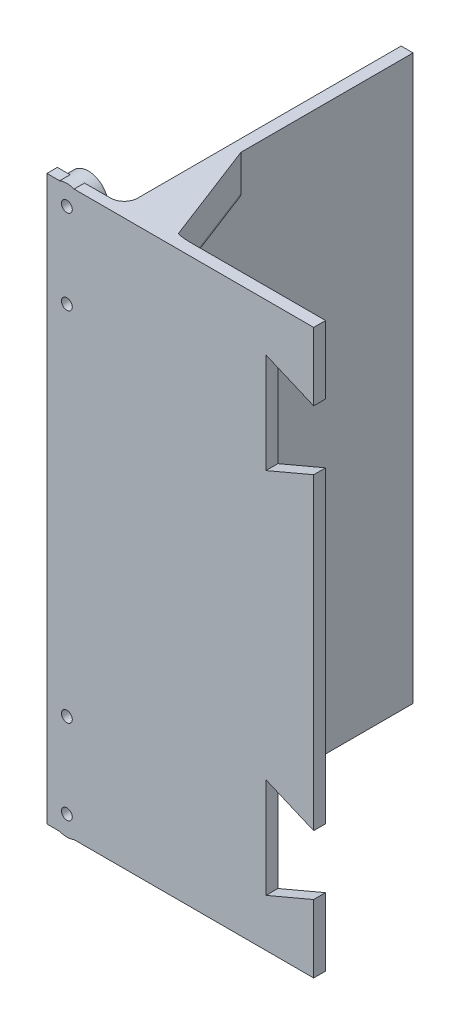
ISO-10303-21;
HEADER;
FILE_DESCRIPTION(('STEP AP214'),'2;1');
FILE_NAME('part.step','',(''),(''),'','','');
FILE_SCHEMA(('AUTOMOTIVE_DESIGN { 1 0 10303 214 1 1 1 1 }'));
ENDSEC;
DATA;
#1=APPLICATION_CONTEXT('core data for automotive mechanical design processes');
#2=APPLICATION_PROTOCOL_DEFINITION('international standard','automotive_design',2000,#1);
#3=PRODUCT_CONTEXT('',#1,'mechanical');
#4=PRODUCT('Part','Part','',(#3));
#5=PRODUCT_RELATED_PRODUCT_CATEGORY('part','',(#4));
#6=PRODUCT_DEFINITION_FORMATION('','',#4);
#7=PRODUCT_DEFINITION_CONTEXT('part definition',#1,'design');
#8=PRODUCT_DEFINITION('design','',#6,#7);
#9=PRODUCT_DEFINITION_SHAPE('','',#8);
#10=(LENGTH_UNIT() NAMED_UNIT(*) SI_UNIT(.MILLI.,.METRE.));
#11=(NAMED_UNIT(*) PLANE_ANGLE_UNIT() SI_UNIT($,.RADIAN.));
#12=(NAMED_UNIT(*) SI_UNIT($,.STERADIAN.) SOLID_ANGLE_UNIT());
#13=UNCERTAINTY_MEASURE_WITH_UNIT(LENGTH_MEASURE(1.E-05),#10,'distance_accuracy_value','');
#14=(GEOMETRIC_REPRESENTATION_CONTEXT(3) GLOBAL_UNCERTAINTY_ASSIGNED_CONTEXT((#13)) GLOBAL_UNIT_ASSIGNED_CONTEXT((#10,
#11,#12)) REPRESENTATION_CONTEXT('',''));
#15=CARTESIAN_POINT('',(0.,0.,0.));
#16=DIRECTION('',(0.,0.,1.));
#17=DIRECTION('',(1.,0.,0.));
#18=AXIS2_PLACEMENT_3D('',#15,#16,#17);
#19=CARTESIAN_POINT('',(-34.8593784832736,132.444376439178,0.316803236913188));
#20=DIRECTION('',(0.,0.,1.));
#21=DIRECTION('',(1.,0.,0.));
#22=AXIS2_PLACEMENT_3D('',#19,#20,#21);
#23=PLANE('',#22);
#24=CARTESIAN_POINT('',(-30.6093784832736,-67.1069532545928,0.316803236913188));
#25=DIRECTION('',(0.,0.,1.));
#26=DIRECTION('',(1.,0.,0.));
#27=AXIS2_PLACEMENT_3D('',#24,#25,#26);
#28=CIRCLE('',#27,4.25);
#29=CARTESIAN_POINT('',(-26.6328850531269,-68.6069532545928,0.316803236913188));
#30=VERTEX_POINT('',#29);
#31=CARTESIAN_POINT('',(-29.0767880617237,-71.071,0.316803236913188));
#32=VERTEX_POINT('',#31);
#33=EDGE_CURVE('E59',#30,#32,#28,.F.);
#34=ORIENTED_EDGE('',*,*,#33,.F.);
#35=DIRECTION('',(0.,-1.,0.));
#36=VECTOR('',#35,1.);
#37=CARTESIAN_POINT('',(-26.6328850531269,132.444376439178,0.316803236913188));
#38=LINE('',#37,#36);
#39=CARTESIAN_POINT('',(-26.6328850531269,-47.6069532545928,0.316803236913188));
#40=VERTEX_POINT('',#39);
#41=EDGE_CURVE('E12',#40,#30,#38,.T.);
#42=ORIENTED_EDGE('',*,*,#41,.F.);
#43=CARTESIAN_POINT('',(-30.6093784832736,-49.1069532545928,0.316803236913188));
#44=DIRECTION('',(0.,0.,1.));
#45=DIRECTION('',(1.,0.,0.));
#46=AXIS2_PLACEMENT_3D('',#43,#44,#45);
#47=CIRCLE('',#46,4.25);
#48=CARTESIAN_POINT('',(-34.5858719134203,-47.6069532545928,0.316803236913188));
#49=VERTEX_POINT('',#48);
#50=EDGE_CURVE('E52',#49,#40,#47,.F.);
#51=ORIENTED_EDGE('',*,*,#50,.F.);
#52=DIRECTION('',(0.,1.,0.));
#53=VECTOR('',#52,1.);
#54=CARTESIAN_POINT('',(-34.5858719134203,132.444376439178,0.316803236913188));
#55=LINE('',#54,#53);
#56=CARTESIAN_POINT('',(-34.5858719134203,-68.6069532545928,0.316803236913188));
#57=VERTEX_POINT('',#56);
#58=EDGE_CURVE('E284',#57,#49,#55,.T.);
#59=ORIENTED_EDGE('',*,*,#58,.F.);
#60=CARTESIAN_POINT('',(-32.1419689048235,-71.071,0.316803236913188));
#61=VERTEX_POINT('',#60);
#62=EDGE_CURVE('E309',#61,#57,#28,.F.);
#63=ORIENTED_EDGE('',*,*,#62,.F.);
#64=DIRECTION('',(1.,0.,0.));
#65=VECTOR('',#64,1.);
#66=CARTESIAN_POINT('',(-34.8593784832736,-71.071,0.316803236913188));
#67=LINE('',#66,#65);
#68=CARTESIAN_POINT('',(-34.8593784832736,-71.071,0.316803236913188));
#69=VERTEX_POINT('',#68);
#70=EDGE_CURVE('E509',#69,#61,#67,.T.);
#71=ORIENTED_EDGE('',*,*,#70,.F.);
#72=DIRECTION('',(0.,-1.,0.));
#73=VECTOR('',#72,1.);
#74=CARTESIAN_POINT('',(-34.8593784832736,132.444376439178,0.316803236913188));
#75=LINE('',#74,#73);
#76=CARTESIAN_POINT('',(-34.8593784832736,48.929,0.316803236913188));
#77=VERTEX_POINT('',#76);
#78=EDGE_CURVE('E446',#77,#69,#75,.T.);
#79=ORIENTED_EDGE('',*,*,#78,.F.);
#80=DIRECTION('',(1.,0.,0.));
#81=VECTOR('',#80,1.);
#82=CARTESIAN_POINT('',(-34.8593784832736,48.929,0.316803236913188));
#83=LINE('',#82,#81);
#84=CARTESIAN_POINT('',(-32.1419689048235,48.929,0.316803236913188));
#85=VERTEX_POINT('',#84);
#86=EDGE_CURVE('E453',#77,#85,#83,.T.);
#87=ORIENTED_EDGE('',*,*,#86,.T.);
#88=CARTESIAN_POINT('',(-30.6093784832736,44.9649532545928,0.316803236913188));
#89=DIRECTION('',(0.,0.,1.));
#90=DIRECTION('',(1.,0.,0.));
#91=AXIS2_PLACEMENT_3D('',#88,#89,#90);
#92=CIRCLE('',#91,4.25);
#93=CARTESIAN_POINT('',(-34.5858719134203,46.4649532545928,0.316803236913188));
#94=VERTEX_POINT('',#93);
#95=EDGE_CURVE('E644',#85,#94,#92,.T.);
#96=ORIENTED_EDGE('',*,*,#95,.T.);
#97=DIRECTION('',(0.,-1.,0.));
#98=VECTOR('',#97,1.);
#99=CARTESIAN_POINT('',(-34.5858719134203,132.444376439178,0.316803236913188));
#100=LINE('',#99,#98);
#101=CARTESIAN_POINT('',(-34.5858719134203,25.4649532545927,0.316803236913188));
#102=VERTEX_POINT('',#101);
#103=EDGE_CURVE('E647',#94,#102,#100,.T.);
#104=ORIENTED_EDGE('',*,*,#103,.T.);
#105=CARTESIAN_POINT('',(-30.6093784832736,26.9649532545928,0.316803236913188));
#106=DIRECTION('',(0.,0.,1.));
#107=DIRECTION('',(1.,0.,0.));
#108=AXIS2_PLACEMENT_3D('',#105,#106,#107);
#109=CIRCLE('',#108,4.25);
#110=CARTESIAN_POINT('',(-26.6328850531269,25.4649532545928,0.316803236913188));
#111=VERTEX_POINT('',#110);
#112=EDGE_CURVE('E663',#102,#111,#109,.T.);
#113=ORIENTED_EDGE('',*,*,#112,.T.);
#114=DIRECTION('',(0.,1.,0.));
#115=VECTOR('',#114,1.);
#116=CARTESIAN_POINT('',(-26.6328850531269,132.444376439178,0.316803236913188));
#117=LINE('',#116,#115);
#118=CARTESIAN_POINT('',(-26.6328850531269,46.4649532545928,0.316803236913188));
#119=VERTEX_POINT('',#118);
#120=EDGE_CURVE('E666',#111,#119,#117,.T.);
#121=ORIENTED_EDGE('',*,*,#120,.T.);
#122=CARTESIAN_POINT('',(-29.0767880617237,48.929,0.316803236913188));
#123=VERTEX_POINT('',#122);
#124=EDGE_CURVE('E649',#119,#123,#92,.T.);
#125=ORIENTED_EDGE('',*,*,#124,.T.);
#126=CARTESIAN_POINT('',(-23.539162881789,48.929,0.316803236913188));
#127=VERTEX_POINT('',#126);
#128=EDGE_CURVE('E448',#123,#127,#83,.T.);
#129=ORIENTED_EDGE('',*,*,#128,.T.);
#130=DIRECTION('',(0.,-1.,0.));
#131=VECTOR('',#130,1.);
#132=CARTESIAN_POINT('',(-23.539162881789,132.444376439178,0.316803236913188));
#133=LINE('',#132,#131);
#134=CARTESIAN_POINT('',(-23.539162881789,-71.071,0.316803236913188));
#135=VERTEX_POINT('',#134);
#136=EDGE_CURVE('E449',#127,#135,#133,.T.);
#137=ORIENTED_EDGE('',*,*,#136,.T.);
#138=EDGE_CURVE('E508',#32,#135,#67,.T.);
#139=ORIENTED_EDGE('',*,*,#138,.F.);
#140=EDGE_LOOP('',(#34,#42,#51,#59,#63,#71,#79,#87,#96,#104,#113,#121,#125,#129,#137,#139));
#141=FACE_BOUND('',#140,.T.);
#142=ADVANCED_FACE('F40',(#141),#23,.F.);
#143=CARTESIAN_POINT('',(-38.0501783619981,-71.071,-114.92));
#144=DIRECTION('',(0.,1.,0.));
#145=DIRECTION('',(1.,0.,0.));
#146=AXIS2_PLACEMENT_3D('',#143,#144,#145);
#147=PLANE('',#146);
#148=DIRECTION('',(0.,0.,1.));
#149=VECTOR('',#148,1.);
#150=CARTESIAN_POINT('',(-32.1419689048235,-71.071,-2.032));
#151=LINE('',#150,#149);
#152=CARTESIAN_POINT('',(-32.1419689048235,-71.071,2.54));
#153=VERTEX_POINT('',#152);
#154=EDGE_CURVE('E634',#153,#61,#151,.F.);
#155=ORIENTED_EDGE('',*,*,#154,.F.);
#156=DIRECTION('',(-1.,0.,0.));
#157=VECTOR('',#156,1.);
#158=CARTESIAN_POINT('',(-34.8593784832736,-71.071,2.54));
#159=LINE('',#158,#157);
#160=CARTESIAN_POINT('',(-34.8593784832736,-71.071,2.54));
#161=VERTEX_POINT('',#160);
#162=EDGE_CURVE('E502',#153,#161,#159,.T.);
#163=ORIENTED_EDGE('',*,*,#162,.T.);
#164=DIRECTION('',(0.,0.,-1.));
#165=VECTOR('',#164,1.);
#166=CARTESIAN_POINT('',(-34.8593784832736,-71.071,0.316803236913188));
#167=LINE('',#166,#165);
#168=EDGE_CURVE('E505',#161,#69,#167,.T.);
#169=ORIENTED_EDGE('',*,*,#168,.T.);
#170=ORIENTED_EDGE('',*,*,#70,.T.);
#171=EDGE_LOOP('',(#155,#163,#169,#170));
#172=FACE_BOUND('',#171,.T.);
#173=ADVANCED_FACE('F635',(#172),#147,.F.);
#174=DIRECTION('',(0.,0.,1.));
#175=VECTOR('',#174,1.);
#176=CARTESIAN_POINT('',(-29.0767880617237,-71.071,-2.032));
#177=LINE('',#176,#175);
#178=CARTESIAN_POINT('',(-29.0767880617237,-71.071,2.54));
#179=VERTEX_POINT('',#178);
#180=EDGE_CURVE('E639',#32,#179,#177,.T.);
#181=ORIENTED_EDGE('',*,*,#180,.F.);
#182=ORIENTED_EDGE('',*,*,#138,.T.);
#183=CARTESIAN_POINT('',(-23.539162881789,-71.071,-2.58908128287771));
#184=DIRECTION('',(0.,1.,0.));
#185=DIRECTION('',(-1.,0.,0.));
#186=AXIS2_PLACEMENT_3D('',#183,#184,#185);
#187=CIRCLE('',#186,2.9058845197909);
#188=CARTESIAN_POINT('',(-20.6332783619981,-71.071,-2.58908128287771));
#189=VERTEX_POINT('',#188);
#190=EDGE_CURVE('E512',#135,#189,#187,.T.);
#191=ORIENTED_EDGE('',*,*,#190,.T.);
#192=DIRECTION('',(0.,0.,-1.));
#193=VECTOR('',#192,1.);
#194=CARTESIAN_POINT('',(-20.6332783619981,-71.071,-2.58908128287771));
#195=LINE('',#194,#193);
#196=CARTESIAN_POINT('',(-20.6332783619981,-71.071,-58.6770963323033));
#197=VERTEX_POINT('',#196);
#198=EDGE_CURVE('E515',#189,#197,#195,.T.);
#199=ORIENTED_EDGE('',*,*,#198,.T.);
#200=DIRECTION('',(1.,0.,0.));
#201=VECTOR('',#200,1.);
#202=CARTESIAN_POINT('',(-18.0932783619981,-71.071,-58.6770963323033));
#203=LINE('',#202,#201);
#204=CARTESIAN_POINT('',(-18.0932783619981,-71.071,-58.6770963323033));
#205=VERTEX_POINT('',#204);
#206=EDGE_CURVE('E518',#197,#205,#203,.T.);
#207=ORIENTED_EDGE('',*,*,#206,.T.);
#208=DIRECTION('',(0.,0.,1.));
#209=VECTOR('',#208,1.);
#210=CARTESIAN_POINT('',(-18.0932783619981,-71.071,-11.0109));
#211=LINE('',#210,#209);
#212=CARTESIAN_POINT('',(-18.0932783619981,-71.071,-22.0218));
#213=VERTEX_POINT('',#212);
#214=EDGE_CURVE('E521',#205,#213,#211,.T.);
#215=ORIENTED_EDGE('',*,*,#214,.T.);
#216=DIRECTION('',(0.359015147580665,0.,0.933331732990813));
#217=VECTOR('',#216,1.);
#218=CARTESIAN_POINT('',(-9.62237836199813,-71.071,0.));
#219=LINE('',#218,#217);
#220=CARTESIAN_POINT('',(-9.74840511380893,-71.071,-0.327631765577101));
#221=VERTEX_POINT('',#220);
#222=EDGE_CURVE('E354',#213,#221,#219,.T.);
#223=ORIENTED_EDGE('',*,*,#222,.T.);
#224=CARTESIAN_POINT('',(-7.08237836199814,-71.071,-11.0109));
#225=DIRECTION('',(0.,1.,0.));
#226=DIRECTION('',(-1.,0.,0.));
#227=AXIS2_PLACEMENT_3D('',#224,#225,#226);
#228=CIRCLE('',#227,11.0109);
#229=CARTESIAN_POINT('',(-7.08237836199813,-71.071,0.));
#230=VERTEX_POINT('',#229);
#231=EDGE_CURVE('E524',#221,#230,#228,.T.);
#232=ORIENTED_EDGE('',*,*,#231,.T.);
#233=DIRECTION('',(1.,0.,0.));
#234=VECTOR('',#233,1.);
#235=CARTESIAN_POINT('',(21.9498216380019,-71.071,0.));
#236=LINE('',#235,#234);
#237=CARTESIAN_POINT('',(21.9498216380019,-71.071,0.));
#238=VERTEX_POINT('',#237);
#239=EDGE_CURVE('E495',#230,#238,#236,.T.);
#240=ORIENTED_EDGE('',*,*,#239,.T.);
#241=DIRECTION('',(0.,0.,1.));
#242=VECTOR('',#241,1.);
#243=CARTESIAN_POINT('',(21.9498216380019,-71.071,2.54000000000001));
#244=LINE('',#243,#242);
#245=CARTESIAN_POINT('',(21.9498216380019,-71.071,2.54000000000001));
#246=VERTEX_POINT('',#245);
#247=EDGE_CURVE('E498',#238,#246,#244,.T.);
#248=ORIENTED_EDGE('',*,*,#247,.T.);
#249=EDGE_CURVE('E503',#246,#179,#159,.T.);
#250=ORIENTED_EDGE('',*,*,#249,.T.);
#251=EDGE_LOOP('',(#181,#182,#191,#199,#207,#215,#223,#232,#240,#248,#250));
#252=FACE_BOUND('',#251,.T.);
#253=ADVANCED_FACE('F811',(#252),#147,.F.);
#254=CARTESIAN_POINT('',(-38.0501783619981,48.929,-114.92));
#255=DIRECTION('',(0.,-1.,0.));
#256=DIRECTION('',(-1.,0.,0.));
#257=AXIS2_PLACEMENT_3D('',#254,#255,#256);
#258=PLANE('',#257);
#259=ORIENTED_EDGE('',*,*,#128,.F.);
#260=DIRECTION('',(0.,0.,1.));
#261=VECTOR('',#260,1.);
#262=CARTESIAN_POINT('',(-29.0767880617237,48.929,-2.032));
#263=LINE('',#262,#261);
#264=CARTESIAN_POINT('',(-29.0767880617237,48.929,2.54));
#265=VERTEX_POINT('',#264);
#266=EDGE_CURVE('E341',#123,#265,#263,.T.);
#267=ORIENTED_EDGE('',*,*,#266,.T.);
#268=DIRECTION('',(-1.,0.,0.));
#269=VECTOR('',#268,1.);
#270=CARTESIAN_POINT('',(-34.8593784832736,48.929,2.54));
#271=LINE('',#270,#269);
#272=CARTESIAN_POINT('',(21.9498216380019,48.929,2.54000000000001));
#273=VERTEX_POINT('',#272);
#274=EDGE_CURVE('E445',#273,#265,#271,.T.);
#275=ORIENTED_EDGE('',*,*,#274,.F.);
#276=DIRECTION('',(0.,0.,1.));
#277=VECTOR('',#276,1.);
#278=CARTESIAN_POINT('',(21.9498216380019,48.929,2.54000000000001));
#279=LINE('',#278,#277);
#280=CARTESIAN_POINT('',(21.9498216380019,48.929,0.));
#281=VERTEX_POINT('',#280);
#282=EDGE_CURVE('E471',#281,#273,#279,.T.);
#283=ORIENTED_EDGE('',*,*,#282,.F.);
#284=DIRECTION('',(1.,0.,0.));
#285=VECTOR('',#284,1.);
#286=CARTESIAN_POINT('',(21.9498216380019,48.929,0.));
#287=LINE('',#286,#285);
#288=CARTESIAN_POINT('',(-7.08237836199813,48.929,0.));
#289=VERTEX_POINT('',#288);
#290=EDGE_CURVE('E466',#289,#281,#287,.T.);
#291=ORIENTED_EDGE('',*,*,#290,.F.);
#292=CARTESIAN_POINT('',(-7.08237836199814,48.929,-11.0109));
#293=DIRECTION('',(0.,-1.,0.));
#294=DIRECTION('',(1.,0.,0.));
#295=AXIS2_PLACEMENT_3D('',#292,#293,#294);
#296=CIRCLE('',#295,11.0109);
#297=CARTESIAN_POINT('',(-9.74840511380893,48.929,-0.327631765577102));
#298=VERTEX_POINT('',#297);
#299=EDGE_CURVE('E467',#298,#289,#296,.F.);
#300=ORIENTED_EDGE('',*,*,#299,.F.);
#301=DIRECTION('',(-0.359015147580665,0.,-0.933331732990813));
#302=VECTOR('',#301,1.);
#303=CARTESIAN_POINT('',(-9.62237836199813,48.929,0.));
#304=LINE('',#303,#302);
#305=CARTESIAN_POINT('',(-18.0932783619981,48.929,-22.0218));
#306=VERTEX_POINT('',#305);
#307=EDGE_CURVE('E418',#298,#306,#304,.T.);
#308=ORIENTED_EDGE('',*,*,#307,.T.);
#309=DIRECTION('',(0.,0.,1.));
#310=VECTOR('',#309,1.);
#311=CARTESIAN_POINT('',(-18.0932783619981,48.929,-11.0109));
#312=LINE('',#311,#310);
#313=CARTESIAN_POINT('',(-18.0932783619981,48.929,-58.6770963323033));
#314=VERTEX_POINT('',#313);
#315=EDGE_CURVE('E462',#314,#306,#312,.T.);
#316=ORIENTED_EDGE('',*,*,#315,.F.);
#317=DIRECTION('',(1.,0.,0.));
#318=VECTOR('',#317,1.);
#319=CARTESIAN_POINT('',(-18.0932783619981,48.929,-58.6770963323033));
#320=LINE('',#319,#318);
#321=CARTESIAN_POINT('',(-20.6332783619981,48.929,-58.6770963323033));
#322=VERTEX_POINT('',#321);
#323=EDGE_CURVE('E459',#322,#314,#320,.T.);
#324=ORIENTED_EDGE('',*,*,#323,.F.);
#325=DIRECTION('',(0.,0.,-1.));
#326=VECTOR('',#325,1.);
#327=CARTESIAN_POINT('',(-20.6332783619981,48.929,-2.58908128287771));
#328=LINE('',#327,#326);
#329=CARTESIAN_POINT('',(-20.6332783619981,48.929,-2.58908128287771));
#330=VERTEX_POINT('',#329);
#331=EDGE_CURVE('E456',#330,#322,#328,.T.);
#332=ORIENTED_EDGE('',*,*,#331,.F.);
#333=CARTESIAN_POINT('',(-23.539162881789,48.929,-2.58908128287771));
#334=DIRECTION('',(0.,-1.,0.));
#335=DIRECTION('',(1.,0.,0.));
#336=AXIS2_PLACEMENT_3D('',#333,#334,#335);
#337=CIRCLE('',#336,2.9058845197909);
#338=EDGE_CURVE('E452',#127,#330,#337,.F.);
#339=ORIENTED_EDGE('',*,*,#338,.F.);
#340=EDGE_LOOP('',(#259,#267,#275,#283,#291,#300,#308,#316,#324,#332,#339));
#341=FACE_BOUND('',#340,.T.);
#342=ADVANCED_FACE('F617',(#341),#258,.F.);
#343=CARTESIAN_POINT('',(21.9498216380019,132.444376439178,2.54000000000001));
#344=DIRECTION('',(-1.,0.,0.));
#345=DIRECTION('',(0.,0.,1.));
#346=AXIS2_PLACEMENT_3D('',#343,#344,#345);
#347=PLANE('',#346);
#348=DIRECTION('',(0.,-1.,0.));
#349=VECTOR('',#348,1.);
#350=CARTESIAN_POINT('',(21.9498216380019,132.444376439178,2.54000000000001));
#351=LINE('',#350,#349);
#352=CARTESIAN_POINT('',(21.9498216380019,21.7563358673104,2.54000000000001));
#353=VERTEX_POINT('',#352);
#354=CARTESIAN_POINT('',(21.9498216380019,-43.8983358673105,2.54000000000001));
#355=VERTEX_POINT('',#354);
#356=EDGE_CURVE('E439',#353,#355,#351,.T.);
#357=ORIENTED_EDGE('',*,*,#356,.T.);
#358=DIRECTION('',(0.,0.,-1.));
#359=VECTOR('',#358,1.);
#360=CARTESIAN_POINT('',(21.9498216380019,-43.8983358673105,2.54000000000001));
#361=LINE('',#360,#359);
#362=CARTESIAN_POINT('',(21.9498216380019,-43.8983358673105,0.));
#363=VERTEX_POINT('',#362);
#364=EDGE_CURVE('E544',#355,#363,#361,.T.);
#365=ORIENTED_EDGE('',*,*,#364,.T.);
#366=DIRECTION('',(0.,-1.,0.));
#367=VECTOR('',#366,1.);
#368=CARTESIAN_POINT('',(21.9498216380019,132.444376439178,0.));
#369=LINE('',#368,#367);
#370=CARTESIAN_POINT('',(21.9498216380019,21.7563358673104,0.));
#371=VERTEX_POINT('',#370);
#372=EDGE_CURVE('E472',#371,#363,#369,.T.);
#373=ORIENTED_EDGE('',*,*,#372,.F.);
#374=DIRECTION('',(0.,0.,-1.));
#375=VECTOR('',#374,1.);
#376=CARTESIAN_POINT('',(21.9498216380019,21.7563358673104,2.54000000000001));
#377=LINE('',#376,#375);
#378=EDGE_CURVE('E526',#353,#371,#377,.T.);
#379=ORIENTED_EDGE('',*,*,#378,.F.);
#380=EDGE_LOOP('',(#357,#365,#373,#379));
#381=FACE_BOUND('',#380,.T.);
#382=ADVANCED_FACE('F597',(#381),#347,.F.);
#383=CARTESIAN_POINT('',(21.9498216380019,34.4563358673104,2.54000000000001));
#384=VERTEX_POINT('',#383);
#385=EDGE_CURVE('E433',#273,#384,#351,.T.);
#386=ORIENTED_EDGE('',*,*,#385,.T.);
#387=DIRECTION('',(0.,0.,-1.));
#388=VECTOR('',#387,1.);
#389=CARTESIAN_POINT('',(21.9498216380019,34.4563358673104,2.54000000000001));
#390=LINE('',#389,#388);
#391=CARTESIAN_POINT('',(21.9498216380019,34.4563358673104,0.));
#392=VERTEX_POINT('',#391);
#393=EDGE_CURVE('E499',#384,#392,#390,.T.);
#394=ORIENTED_EDGE('',*,*,#393,.T.);
#395=EDGE_CURVE('E468',#281,#392,#369,.T.);
#396=ORIENTED_EDGE('',*,*,#395,.F.);
#397=ORIENTED_EDGE('',*,*,#282,.T.);
#398=EDGE_LOOP('',(#386,#394,#396,#397));
#399=FACE_BOUND('',#398,.T.);
#400=ADVANCED_FACE('F612',(#399),#347,.F.);
#401=CARTESIAN_POINT('',(-32.1419689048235,48.929,2.54));
#402=VERTEX_POINT('',#401);
#403=CARTESIAN_POINT('',(-34.8593784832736,48.929,2.54));
#404=VERTEX_POINT('',#403);
#405=EDGE_CURVE('E494',#402,#404,#271,.T.);
#406=ORIENTED_EDGE('',*,*,#405,.F.);
#407=DIRECTION('',(0.,0.,1.));
#408=VECTOR('',#407,1.);
#409=CARTESIAN_POINT('',(-32.1419689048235,48.929,-2.032));
#410=LINE('',#409,#408);
#411=EDGE_CURVE('E351',#402,#85,#410,.F.);
#412=ORIENTED_EDGE('',*,*,#411,.T.);
#413=ORIENTED_EDGE('',*,*,#86,.F.);
#414=DIRECTION('',(0.,0.,-1.));
#415=VECTOR('',#414,1.);
#416=CARTESIAN_POINT('',(-34.8593784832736,48.929,0.316803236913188));
#417=LINE('',#416,#415);
#418=EDGE_CURVE('E444',#404,#77,#417,.T.);
#419=ORIENTED_EDGE('',*,*,#418,.F.);
#420=EDGE_LOOP('',(#406,#412,#413,#419));
#421=FACE_BOUND('',#420,.T.);
#422=ADVANCED_FACE('F624',(#421),#258,.F.);
#423=CARTESIAN_POINT('',(-34.8593784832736,132.444376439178,2.54));
#424=DIRECTION('',(0.,0.,-1.));
#425=DIRECTION('',(-1.,0.,0.));
#426=AXIS2_PLACEMENT_3D('',#423,#424,#425);
#427=PLANE('',#426);
#428=CARTESIAN_POINT('',(-30.6093660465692,-49.1069532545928,2.54000000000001));
#429=DIRECTION('',(0.,0.,1.));
#430=DIRECTION('',(-1.,0.,0.));
#431=AXIS2_PLACEMENT_3D('',#428,#429,#430);
#432=CIRCLE('',#431,1.15);
#433=CARTESIAN_POINT('',(-31.7593660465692,-49.1069532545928,2.54000000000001));
#434=VERTEX_POINT('',#433);
#435=EDGE_CURVE('E861',#434,#434,#432,.T.);
#436=ORIENTED_EDGE('',*,*,#435,.F.);
#437=EDGE_LOOP('',(#436));
#438=FACE_BOUND('',#437,.T.);
#439=CARTESIAN_POINT('',(-30.6093660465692,-67.1069532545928,2.54000000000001));
#440=DIRECTION('',(0.,0.,1.));
#441=DIRECTION('',(-1.,0.,0.));
#442=AXIS2_PLACEMENT_3D('',#439,#440,#441);
#443=CIRCLE('',#442,1.15);
#444=CARTESIAN_POINT('',(-31.7593660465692,-67.1069532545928,2.54000000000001));
#445=VERTEX_POINT('',#444);
#446=EDGE_CURVE('E295',#445,#445,#443,.T.);
#447=ORIENTED_EDGE('',*,*,#446,.F.);
#448=EDGE_LOOP('',(#447));
#449=FACE_BOUND('',#448,.T.);
#450=ORIENTED_EDGE('',*,*,#162,.F.);
#451=CARTESIAN_POINT('',(-30.6093784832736,-67.1069532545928,2.54));
#452=DIRECTION('',(0.,0.,-1.));
#453=DIRECTION('',(1.,0.,0.));
#454=AXIS2_PLACEMENT_3D('',#451,#452,#453);
#455=CIRCLE('',#454,4.25);
#456=EDGE_CURVE('E292',#179,#153,#455,.T.);
#457=ORIENTED_EDGE('',*,*,#456,.F.);
#458=ORIENTED_EDGE('',*,*,#249,.F.);
#459=CARTESIAN_POINT('',(21.9498216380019,-56.5983358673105,2.54000000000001));
#460=VERTEX_POINT('',#459);
#461=EDGE_CURVE('E440',#460,#246,#351,.T.);
#462=ORIENTED_EDGE('',*,*,#461,.F.);
#463=DIRECTION('',(-0.920504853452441,-0.390731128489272,0.));
#464=VECTOR('',#463,1.);
#465=CARTESIAN_POINT('',(11.7898216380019,-60.911,2.54000000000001));
#466=LINE('',#465,#464);
#467=CARTESIAN_POINT('',(11.7898216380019,-60.911,2.54000000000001));
#468=VERTEX_POINT('',#467);
#469=EDGE_CURVE('E427',#460,#468,#466,.T.);
#470=ORIENTED_EDGE('',*,*,#469,.T.);
#471=DIRECTION('',(0.,1.,0.));
#472=VECTOR('',#471,1.);
#473=CARTESIAN_POINT('',(11.7898216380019,-39.5856717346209,2.54000000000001));
#474=LINE('',#473,#472);
#475=CARTESIAN_POINT('',(11.7898216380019,-39.5856717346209,2.54000000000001));
#476=VERTEX_POINT('',#475);
#477=EDGE_CURVE('E569',#468,#476,#474,.T.);
#478=ORIENTED_EDGE('',*,*,#477,.T.);
#479=DIRECTION('',(0.920504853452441,-0.390731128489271,0.));
#480=VECTOR('',#479,1.);
#481=CARTESIAN_POINT('',(21.9498216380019,-43.8983358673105,2.54000000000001));
#482=LINE('',#481,#480);
#483=EDGE_CURVE('E555',#476,#355,#482,.T.);
#484=ORIENTED_EDGE('',*,*,#483,.T.);
#485=ORIENTED_EDGE('',*,*,#356,.F.);
#486=DIRECTION('',(-0.920504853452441,-0.390731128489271,0.));
#487=VECTOR('',#486,1.);
#488=CARTESIAN_POINT('',(11.7898216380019,17.4436717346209,2.54000000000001));
#489=LINE('',#488,#487);
#490=CARTESIAN_POINT('',(11.7898216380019,17.4436717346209,2.54000000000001));
#491=VERTEX_POINT('',#490);
#492=EDGE_CURVE('E537',#353,#491,#489,.T.);
#493=ORIENTED_EDGE('',*,*,#492,.T.);
#494=DIRECTION('',(0.,1.,0.));
#495=VECTOR('',#494,1.);
#496=CARTESIAN_POINT('',(11.7898216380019,38.769,2.54000000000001));
#497=LINE('',#496,#495);
#498=CARTESIAN_POINT('',(11.7898216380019,38.769,2.54000000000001));
#499=VERTEX_POINT('',#498);
#500=EDGE_CURVE('E547',#491,#499,#497,.T.);
#501=ORIENTED_EDGE('',*,*,#500,.T.);
#502=DIRECTION('',(0.920504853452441,-0.390731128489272,0.));
#503=VECTOR('',#502,1.);
#504=CARTESIAN_POINT('',(21.9498216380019,34.4563358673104,2.54000000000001));
#505=LINE('',#504,#503);
#506=EDGE_CURVE('E529',#499,#384,#505,.T.);
#507=ORIENTED_EDGE('',*,*,#506,.T.);
#508=ORIENTED_EDGE('',*,*,#385,.F.);
#509=ORIENTED_EDGE('',*,*,#274,.T.);
#510=CARTESIAN_POINT('',(-30.6093784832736,44.9649532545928,2.54));
#511=DIRECTION('',(0.,0.,1.));
#512=DIRECTION('',(1.,0.,0.));
#513=AXIS2_PLACEMENT_3D('',#510,#511,#512);
#514=CIRCLE('',#513,4.25);
#515=EDGE_CURVE('E320',#265,#402,#514,.T.);
#516=ORIENTED_EDGE('',*,*,#515,.T.);
#517=ORIENTED_EDGE('',*,*,#405,.T.);
#518=DIRECTION('',(0.,-1.,0.));
#519=VECTOR('',#518,1.);
#520=CARTESIAN_POINT('',(-34.8593784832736,132.444376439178,2.54));
#521=LINE('',#520,#519);
#522=EDGE_CURVE('E441',#404,#161,#521,.T.);
#523=ORIENTED_EDGE('',*,*,#522,.T.);
#524=EDGE_LOOP('',(#450,#457,#458,#462,#470,#478,#484,#485,#493,#501,#507,#508,#509,#516,#517,#523));
#525=FACE_BOUND('',#524,.T.);
#526=CARTESIAN_POINT('',(-30.6093660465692,44.9649532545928,2.54000000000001));
#527=DIRECTION('',(0.,0.,-1.));
#528=DIRECTION('',(-1.,0.,0.));
#529=AXIS2_PLACEMENT_3D('',#526,#527,#528);
#530=CIRCLE('',#529,1.15);
#531=CARTESIAN_POINT('',(-31.7593660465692,44.9649532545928,2.54000000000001));
#532=VERTEX_POINT('',#531);
#533=EDGE_CURVE('E317',#532,#532,#530,.T.);
#534=ORIENTED_EDGE('',*,*,#533,.T.);
#535=EDGE_LOOP('',(#534));
#536=FACE_BOUND('',#535,.T.);
#537=CARTESIAN_POINT('',(-30.6093660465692,26.9649532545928,2.54000000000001));
#538=DIRECTION('',(0.,0.,-1.));
#539=DIRECTION('',(-1.,0.,0.));
#540=AXIS2_PLACEMENT_3D('',#537,#538,#539);
#541=CIRCLE('',#540,1.15);
#542=CARTESIAN_POINT('',(-31.7593660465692,26.9649532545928,2.54000000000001));
#543=VERTEX_POINT('',#542);
#544=EDGE_CURVE('E310',#543,#543,#541,.T.);
#545=ORIENTED_EDGE('',*,*,#544,.T.);
#546=EDGE_LOOP('',(#545));
#547=FACE_BOUND('',#546,.T.);
#548=ADVANCED_FACE('F575',(#438,#449,#525,#536,#547),#427,.F.);
#549=CARTESIAN_POINT('',(-34.8593784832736,132.444376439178,0.316803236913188));
#550=DIRECTION('',(1.,0.,0.));
#551=DIRECTION('',(0.,0.,-1.));
#552=AXIS2_PLACEMENT_3D('',#549,#550,#551);
#553=PLANE('',#552);
#554=ORIENTED_EDGE('',*,*,#522,.F.);
#555=ORIENTED_EDGE('',*,*,#418,.T.);
#556=ORIENTED_EDGE('',*,*,#78,.T.);
#557=ORIENTED_EDGE('',*,*,#168,.F.);
#558=EDGE_LOOP('',(#554,#555,#556,#557));
#559=FACE_BOUND('',#558,.T.);
#560=ADVANCED_FACE('F629',(#559),#553,.F.);
#561=CARTESIAN_POINT('',(-23.539162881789,132.444376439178,-2.58908128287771));
#562=DIRECTION('',(0.,-1.,0.));
#563=DIRECTION('',(0.,0.,-1.));
#564=AXIS2_PLACEMENT_3D('',#561,#562,#563);
#565=CYLINDRICAL_SURFACE('',#564,2.9058845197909);
#566=ORIENTED_EDGE('',*,*,#136,.F.);
#567=ORIENTED_EDGE('',*,*,#338,.T.);
#568=DIRECTION('',(0.,-1.,0.));
#569=VECTOR('',#568,1.);
#570=CARTESIAN_POINT('',(-20.6332783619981,132.444376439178,-2.58908128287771));
#571=LINE('',#570,#569);
#572=EDGE_CURVE('E454',#330,#189,#571,.T.);
#573=ORIENTED_EDGE('',*,*,#572,.T.);
#574=ORIENTED_EDGE('',*,*,#190,.F.);
#575=EDGE_LOOP('',(#566,#567,#573,#574));
#576=FACE_BOUND('',#575,.T.);
#577=ADVANCED_FACE('F824',(#576),#565,.F.);
#578=CARTESIAN_POINT('',(-20.6332783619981,132.444376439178,-2.58908128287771));
#579=DIRECTION('',(1.,0.,0.));
#580=DIRECTION('',(0.,0.,-1.));
#581=AXIS2_PLACEMENT_3D('',#578,#579,#580);
#582=PLANE('',#581);
#583=ORIENTED_EDGE('',*,*,#572,.F.);
#584=ORIENTED_EDGE('',*,*,#331,.T.);
#585=DIRECTION('',(0.,-1.,0.));
#586=VECTOR('',#585,1.);
#587=CARTESIAN_POINT('',(-20.6332783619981,132.444376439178,-58.6770963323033));
#588=LINE('',#587,#586);
#589=EDGE_CURVE('E457',#322,#197,#588,.T.);
#590=ORIENTED_EDGE('',*,*,#589,.T.);
#591=ORIENTED_EDGE('',*,*,#198,.F.);
#592=EDGE_LOOP('',(#583,#584,#590,#591));
#593=FACE_BOUND('',#592,.T.);
#594=ADVANCED_FACE('F821',(#593),#582,.F.);
#595=CARTESIAN_POINT('',(-18.0932783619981,132.444376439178,-58.6770963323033));
#596=DIRECTION('',(0.,0.,1.));
#597=DIRECTION('',(1.,0.,0.));
#598=AXIS2_PLACEMENT_3D('',#595,#596,#597);
#599=PLANE('',#598);
#600=ORIENTED_EDGE('',*,*,#589,.F.);
#601=ORIENTED_EDGE('',*,*,#323,.T.);
#602=DIRECTION('',(0.,-1.,0.));
#603=VECTOR('',#602,1.);
#604=CARTESIAN_POINT('',(-18.0932783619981,132.444376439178,-58.6770963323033));
#605=LINE('',#604,#603);
#606=EDGE_CURVE('E460',#314,#205,#605,.T.);
#607=ORIENTED_EDGE('',*,*,#606,.T.);
#608=ORIENTED_EDGE('',*,*,#206,.F.);
#609=EDGE_LOOP('',(#600,#601,#607,#608));
#610=FACE_BOUND('',#609,.T.);
#611=ADVANCED_FACE('F816',(#610),#599,.F.);
#612=CARTESIAN_POINT('',(-18.0932783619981,132.444376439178,-11.0109));
#613=DIRECTION('',(-1.,0.,0.));
#614=DIRECTION('',(0.,0.,1.));
#615=AXIS2_PLACEMENT_3D('',#612,#613,#614);
#616=PLANE('',#615);
#617=DIRECTION('',(0.,-1.,0.));
#618=VECTOR('',#617,1.);
#619=CARTESIAN_POINT('',(-18.0932783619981,132.444376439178,-11.0109));
#620=LINE('',#619,#618);
#621=CARTESIAN_POINT('',(-18.0932783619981,38.8322858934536,-11.0109));
#622=VERTEX_POINT('',#621);
#623=CARTESIAN_POINT('',(-18.0932783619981,-58.2082,-11.0109));
#624=VERTEX_POINT('',#623);
#625=EDGE_CURVE('E486',#622,#624,#620,.T.);
#626=ORIENTED_EDGE('',*,*,#625,.T.);
#627=DIRECTION('',(0.,0.,-1.));
#628=VECTOR('',#627,1.);
#629=CARTESIAN_POINT('',(-18.0932783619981,-58.2082,0.));
#630=LINE('',#629,#628);
#631=CARTESIAN_POINT('',(-18.0932783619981,-58.2082,-14.9468896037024));
#632=VERTEX_POINT('',#631);
#633=EDGE_CURVE('E357',#624,#632,#630,.T.);
#634=ORIENTED_EDGE('',*,*,#633,.T.);
#635=CARTESIAN_POINT('',(-18.0932783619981,-63.2882,-22.0218));
#636=CARTESIAN_POINT('',(-18.0932779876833,-63.2388081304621,-22.0218004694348));
#637=CARTESIAN_POINT('',(-18.0932728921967,-63.1894172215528,-22.0207826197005));
#638=CARTESIAN_POINT('',(-18.0932587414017,-63.0905054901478,-22.0167264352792));
#639=CARTESIAN_POINT('',(-18.0932496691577,-63.0409850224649,-22.0136794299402));
#640=CARTESIAN_POINT('',(-18.0932331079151,-62.9418827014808,-22.0055629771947));
#641=CARTESIAN_POINT('',(-18.0932256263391,-62.8923016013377,-22.0004843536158));
#642=CARTESIAN_POINT('',(-18.09321523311,-62.7931468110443,-21.9883040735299));
#643=CARTESIAN_POINT('',(-18.0932123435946,-62.7435743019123,-21.9811928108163));
#644=CARTESIAN_POINT('',(-18.0932122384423,-62.6445063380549,-21.9649472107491));
#645=CARTESIAN_POINT('',(-18.0932150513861,-62.5950125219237,-21.955802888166));
#646=CARTESIAN_POINT('',(-18.093225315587,-62.4961718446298,-21.9354918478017));
#647=CARTESIAN_POINT('',(-18.0932327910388,-62.4468271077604,-21.9243147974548));
#648=CARTESIAN_POINT('',(-18.093249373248,-62.3483544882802,-21.8999400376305));
#649=CARTESIAN_POINT('',(-18.0932584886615,-62.2992292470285,-21.8867316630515));
#650=CARTESIAN_POINT('',(-18.0932728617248,-62.2012650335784,-21.8582956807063));
#651=CARTESIAN_POINT('',(-18.093278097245,-62.1524292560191,-21.8430570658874));
#652=CARTESIAN_POINT('',(-18.0932786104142,-62.0583928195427,-21.8116620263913));
#653=CARTESIAN_POINT('',(-18.093274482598,-62.01315380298,-21.7956202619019));
#654=CARTESIAN_POINT('',(-18.0932638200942,-61.9227293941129,-21.7617060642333));
#655=CARTESIAN_POINT('',(-18.0932572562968,-61.8775515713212,-21.7438134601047));
#656=CARTESIAN_POINT('',(-18.0932451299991,-61.7873052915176,-21.7061953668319));
#657=CARTESIAN_POINT('',(-18.0932395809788,-61.742245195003,-21.6864498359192));
#658=CARTESIAN_POINT('',(-18.0932318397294,-61.6522906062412,-21.6451250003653));
#659=CARTESIAN_POINT('',(-18.0932296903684,-61.6074052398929,-21.6235258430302));
#660=CARTESIAN_POINT('',(-18.0932295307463,-61.5178573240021,-21.5784931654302));
#661=CARTESIAN_POINT('',(-18.0932315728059,-61.473204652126,-21.5550400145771));
#662=CARTESIAN_POINT('',(-18.0932390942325,-61.3841798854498,-21.5062993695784));
#663=CARTESIAN_POINT('',(-18.0932446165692,-61.3398184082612,-21.4809924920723));
#664=CARTESIAN_POINT('',(-18.0932568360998,-61.2514342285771,-21.4285450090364));
#665=CARTESIAN_POINT('',(-18.0932635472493,-61.2074228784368,-21.4013852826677));
#666=CARTESIAN_POINT('',(-18.0932743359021,-61.1197970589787,-21.3452331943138));
#667=CARTESIAN_POINT('',(-18.0932783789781,-61.0761946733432,-21.3162219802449));
#668=CARTESIAN_POINT('',(-18.0932783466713,-60.9941894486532,-21.2596421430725));
#669=CARTESIAN_POINT('',(-18.0932750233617,-60.9556936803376,-21.2322080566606));
#670=CARTESIAN_POINT('',(-18.0932660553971,-60.8788656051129,-21.1757300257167));
#671=CARTESIAN_POINT('',(-18.0932603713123,-60.8405478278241,-21.1466663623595));
#672=CARTESIAN_POINT('',(-18.0932448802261,-60.724933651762,-21.056292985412));
#673=CARTESIAN_POINT('',(-18.0932370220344,-60.6490143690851,-20.9932087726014));
#674=CARTESIAN_POINT('',(-18.093236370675,-60.4983689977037,-20.8606608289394));
#675=CARTESIAN_POINT('',(-18.0932440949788,-60.4237696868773,-20.7910536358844));
#676=CARTESIAN_POINT('',(-18.0932654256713,-60.2761680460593,-20.6454472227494));
#677=CARTESIAN_POINT('',(-18.0932792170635,-60.2032988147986,-20.5693131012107));
#678=CARTESIAN_POINT('',(-18.093277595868,-60.069213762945,-20.4212872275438));
#679=CARTESIAN_POINT('',(-18.0932650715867,-60.0075741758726,-20.3497778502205));
#680=CARTESIAN_POINT('',(-18.0932443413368,-59.8851611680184,-20.2009135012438));
#681=CARTESIAN_POINT('',(-18.0932363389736,-59.8245330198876,-20.1234391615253));
#682=CARTESIAN_POINT('',(-18.0932353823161,-59.7045496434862,-19.962632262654));
#683=CARTESIAN_POINT('',(-18.0932430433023,-59.6453425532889,-19.8791893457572));
#684=CARTESIAN_POINT('',(-18.0932654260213,-59.5286186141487,-19.7064389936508));
#685=CARTESIAN_POINT('',(-18.0932804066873,-59.4712531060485,-19.6170293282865));
#686=CARTESIAN_POINT('',(-18.0932765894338,-59.3680425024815,-19.4477488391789));
#687=CARTESIAN_POINT('',(-18.093262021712,-59.3216802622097,-19.368192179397));
#688=CARTESIAN_POINT('',(-18.0932374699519,-59.2295306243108,-19.2029644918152));
#689=CARTESIAN_POINT('',(-18.0932277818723,-59.1839148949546,-19.1171977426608));
#690=CARTESIAN_POINT('',(-18.0932257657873,-59.0937440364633,-18.9395381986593));
#691=CARTESIAN_POINT('',(-18.0932343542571,-59.0493634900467,-18.8475569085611));
#692=CARTESIAN_POINT('',(-18.0932636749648,-58.9621625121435,-18.6574651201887));
#693=CARTESIAN_POINT('',(-18.0932849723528,-58.9195202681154,-18.5592728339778));
#694=CARTESIAN_POINT('',(-18.0932730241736,-58.8460206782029,-18.3803287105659));
#695=CARTESIAN_POINT('',(-18.0932494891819,-58.8144749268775,-18.2998583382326));
#696=CARTESIAN_POINT('',(-18.0932055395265,-58.7506673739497,-18.1293897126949));
#697=CARTESIAN_POINT('',(-18.0931857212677,-58.7186850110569,-18.0392867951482));
#698=CARTESIAN_POINT('',(-18.0931853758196,-58.6548430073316,-17.8495409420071));
#699=CARTESIAN_POINT('',(-18.0932087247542,-58.6232785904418,-17.7497987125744));
#700=CARTESIAN_POINT('',(-18.0932400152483,-58.5612088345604,-17.5407669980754));
#701=CARTESIAN_POINT('',(-18.0932464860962,-58.5310190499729,-17.4313837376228));
#702=CARTESIAN_POINT('',(-18.093306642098,-58.4779156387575,-17.2239700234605));
#703=CARTESIAN_POINT('',(-18.0933549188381,-58.4545653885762,-17.1260508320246));
#704=CARTESIAN_POINT('',(-18.093504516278,-58.4111779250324,-16.9300401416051));
#705=CARTESIAN_POINT('',(-18.0936055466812,-58.3911233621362,-16.8319524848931));
#706=CARTESIAN_POINT('',(-18.0937507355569,-58.3542873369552,-16.6356416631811));
#707=CARTESIAN_POINT('',(-18.0937951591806,-58.3374909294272,-16.5374213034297));
#708=CARTESIAN_POINT('',(-18.0936515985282,-58.3071235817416,-16.3408810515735));
#709=CARTESIAN_POINT('',(-18.0934645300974,-58.2935401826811,-16.242563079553));
#710=CARTESIAN_POINT('',(-18.0930899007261,-58.2692245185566,-16.0443470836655));
#711=CARTESIAN_POINT('',(-18.0929023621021,-58.2585294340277,-15.9444445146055));
#712=CARTESIAN_POINT('',(-18.0927635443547,-58.2401986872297,-15.7446957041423));
#713=CARTESIAN_POINT('',(-18.0928114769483,-58.2325529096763,-15.6448503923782));
#714=CARTESIAN_POINT('',(-18.0929555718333,-58.2203501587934,-15.4452525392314));
#715=CARTESIAN_POINT('',(-18.0930515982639,-58.2157845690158,-15.3455005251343));
#716=CARTESIAN_POINT('',(-18.093210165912,-58.2097115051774,-15.1461286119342));
#717=CARTESIAN_POINT('',(-18.0932727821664,-58.2081971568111,-15.0465089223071));
#718=CARTESIAN_POINT('',(-18.0932783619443,-58.2082,-14.9468896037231));
#719=B_SPLINE_CURVE_WITH_KNOTS('',3,(#635,#636,#637,#638,#639,#640,#641,#642,#643,#644,#645,
#646,#647,#648,#649,#650,#651,#652,#653,#654,#655,#656,#657,#658,#659,#660,#661,#662,#663,#664,
#665,#666,#667,#668,#669,#670,#671,#672,#673,#674,#675,#676,#677,#678,#679,#680,#681,#682,#683,
#684,#685,#686,#687,#688,#689,#690,#691,#692,#693,#694,#695,#696,#697,#698,#699,#700,#701,#702,
#703,#704,#705,#706,#707,#708,#709,#710,#711,#712,#713,#714,#715,#716,#717,#718),.UNSPECIFIED.,
.F.,.F.,(4,2,2,2,2,2,2,2,2,2,2,2,2,2,2,2,2,2,2,2,2,2,2,2,2,2,2,2,2,2,2,2,2,2,2,2,2,2,2,2,2,4),
(0.,0.148163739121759,0.296964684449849,0.446445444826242,0.596644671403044,0.747598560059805,
0.899342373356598,1.05191195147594,1.20534518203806,1.34931050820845,1.49505470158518,
1.64261296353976,1.79201743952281,1.9432982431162,2.09648446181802,2.2516051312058,
2.40869016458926,2.55048173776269,2.69474335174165,2.9906856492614,3.29661744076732,
3.61260549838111,3.89572767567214,4.190748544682,4.49758066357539,4.81615233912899,
5.09232576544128,5.38367929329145,5.68998572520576,6.01105000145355,6.27030761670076,
6.55708523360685,6.87087093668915,7.21120510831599,7.5131474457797,7.81344547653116,
8.11233165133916,8.41003912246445,8.71141368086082,9.01178002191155,9.31130260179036,
9.6101496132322),.UNSPECIFIED.);
#720=CARTESIAN_POINT('',(-18.0932783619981,-63.2882,-22.0218));
#721=VERTEX_POINT('',#720);
#722=EDGE_CURVE('E669',#632,#721,#719,.F.);
#723=ORIENTED_EDGE('',*,*,#722,.T.);
#724=DIRECTION('',(0.,-1.,0.));
#725=VECTOR('',#724,1.);
#726=CARTESIAN_POINT('',(-18.0932783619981,-34.6133738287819,-22.0218));
#727=LINE('',#726,#725);
#728=EDGE_CURVE('E366',#721,#213,#727,.T.);
#729=ORIENTED_EDGE('',*,*,#728,.T.);
#730=ORIENTED_EDGE('',*,*,#214,.F.);
#731=ORIENTED_EDGE('',*,*,#606,.F.);
#732=ORIENTED_EDGE('',*,*,#315,.T.);
#733=DIRECTION('',(0.,1.,0.));
#734=VECTOR('',#733,1.);
#735=CARTESIAN_POINT('',(-18.0932783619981,15.1741738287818,-22.0218));
#736=LINE('',#735,#734);
#737=CARTESIAN_POINT('',(-18.0932783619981,41.309,-22.0218));
#738=VERTEX_POINT('',#737);
#739=EDGE_CURVE('E424',#738,#306,#736,.T.);
#740=ORIENTED_EDGE('',*,*,#739,.F.);
#741=CARTESIAN_POINT('',(-18.0932783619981,38.8322858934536,-11.0109000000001));
#742=CARTESIAN_POINT('',(-18.0932761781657,38.8417615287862,-11.2429369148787));
#743=CARTESIAN_POINT('',(-18.0931109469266,38.8523590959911,-11.474928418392));
#744=CARTESIAN_POINT('',(-18.0927471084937,38.8744255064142,-11.9104592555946));
#745=CARTESIAN_POINT('',(-18.092555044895,38.8856297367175,-12.1140120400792));
#746=CARTESIAN_POINT('',(-18.0923261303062,38.9081674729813,-12.4926036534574));
#747=CARTESIAN_POINT('',(-18.0922713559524,38.9192646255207,-12.667656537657));
#748=CARTESIAN_POINT('',(-18.0923327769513,38.9409258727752,-12.9892423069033));
#749=CARTESIAN_POINT('',(-18.0924226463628,38.9512837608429,-13.135789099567));
#750=CARTESIAN_POINT('',(-18.092714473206,38.9708898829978,-13.4003944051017));
#751=CARTESIAN_POINT('',(-18.0928913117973,38.9799637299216,-13.5184658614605));
#752=CARTESIAN_POINT('',(-18.0931450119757,38.9965452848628,-13.7261697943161));
#753=CARTESIAN_POINT('',(-18.0932356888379,39.0039049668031,-13.8158140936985));
#754=CARTESIAN_POINT('',(-18.0933668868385,39.0271941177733,-14.0913687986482));
#755=CARTESIAN_POINT('',(-18.0932488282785,39.0438348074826,-14.2772197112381));
#756=CARTESIAN_POINT('',(-18.0930836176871,39.0780256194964,-14.6386228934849));
#757=CARTESIAN_POINT('',(-18.0930329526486,39.0954767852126,-14.8141845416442));
#758=CARTESIAN_POINT('',(-18.0929529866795,39.1311098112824,-15.1549860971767));
#759=CARTESIAN_POINT('',(-18.0929226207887,39.149191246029,-15.3202364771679));
#760=CARTESIAN_POINT('',(-18.0929255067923,39.1858836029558,-15.6404091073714));
#761=CARTESIAN_POINT('',(-18.0929549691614,39.2043939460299,-15.7953428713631));
#762=CARTESIAN_POINT('',(-18.0930524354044,39.2417573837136,-16.0948892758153));
#763=CARTESIAN_POINT('',(-18.0931177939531,39.2605089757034,-16.2395145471));
#764=CARTESIAN_POINT('',(-18.093227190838,39.2981807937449,-16.5184616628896));
#765=CARTESIAN_POINT('',(-18.0932723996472,39.316997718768,-16.6527974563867));
#766=CARTESIAN_POINT('',(-18.0932867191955,39.3639429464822,-16.9751733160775));
#767=CARTESIAN_POINT('',(-18.0932179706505,39.3927755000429,-17.1631116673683));
#768=CARTESIAN_POINT('',(-18.0930687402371,39.4517632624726,-17.5269095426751));
#769=CARTESIAN_POINT('',(-18.0929892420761,39.4817275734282,-17.7027999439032));
#770=CARTESIAN_POINT('',(-18.0928791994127,39.5427754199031,-18.0424723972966));
#771=CARTESIAN_POINT('',(-18.0928457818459,39.5736560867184,-18.2062907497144));
#772=CARTESIAN_POINT('',(-18.0928503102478,39.6363366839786,-18.5218055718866));
#773=CARTESIAN_POINT('',(-18.0928834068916,39.6679195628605,-18.6735449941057));
#774=CARTESIAN_POINT('',(-18.0930016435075,39.7318107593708,-18.9649062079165));
#775=CARTESIAN_POINT('',(-18.0930826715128,39.7638848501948,-19.104579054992));
#776=CARTESIAN_POINT('',(-18.0932132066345,39.8285972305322,-19.3718159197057));
#777=CARTESIAN_POINT('',(-18.0932647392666,39.8609781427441,-19.4994420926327));
#778=CARTESIAN_POINT('',(-18.093297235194,39.9422180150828,-19.8028286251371));
#779=CARTESIAN_POINT('',(-18.0932433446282,39.9926178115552,-19.9781822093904));
#780=CARTESIAN_POINT('',(-18.0931970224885,40.095467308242,-20.3060639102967));
#781=CARTESIAN_POINT('',(-18.0931981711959,40.1469966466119,-20.4588745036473));
#782=CARTESIAN_POINT('',(-18.0932295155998,40.2283779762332,-20.6781835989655));
#783=CARTESIAN_POINT('',(-18.0932434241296,40.2546065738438,-20.7460258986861));
#784=CARTESIAN_POINT('',(-18.0932670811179,40.3073535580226,-20.8760041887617));
#785=CARTESIAN_POINT('',(-18.0932770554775,40.3337179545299,-20.9382021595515));
#786=CARTESIAN_POINT('',(-18.0932792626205,40.3802236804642,-21.0423974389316));
#787=CARTESIAN_POINT('',(-18.0932760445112,40.3997537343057,-21.0846673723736));
#788=CARTESIAN_POINT('',(-18.0932695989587,40.4389959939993,-21.1663403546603));
#789=CARTESIAN_POINT('',(-18.0932663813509,40.4586417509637,-21.2057752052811));
#790=CARTESIAN_POINT('',(-18.0932617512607,40.4981009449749,-21.2817722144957));
#791=CARTESIAN_POINT('',(-18.093260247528,40.5178429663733,-21.3183713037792));
#792=CARTESIAN_POINT('',(-18.0932602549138,40.5574803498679,-21.3886904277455));
#793=CARTESIAN_POINT('',(-18.0932615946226,40.5772990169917,-21.4224535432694));
#794=CARTESIAN_POINT('',(-18.0932664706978,40.6170767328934,-21.4870971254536));
#795=CARTESIAN_POINT('',(-18.0932698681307,40.6369535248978,-21.5180278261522));
#796=CARTESIAN_POINT('',(-18.0932742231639,40.6673500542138,-21.5629712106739));
#797=CARTESIAN_POINT('',(-18.0932755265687,40.6773171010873,-21.5773586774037));
#798=CARTESIAN_POINT('',(-18.0932778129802,40.6972697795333,-21.6054166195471));
#799=CARTESIAN_POINT('',(-18.0932788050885,40.707244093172,-21.6190951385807));
#800=CARTESIAN_POINT('',(-18.093277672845,40.7331889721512,-21.6537086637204));
#801=CARTESIAN_POINT('',(-18.0932735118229,40.7494133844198,-21.6744549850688));
#802=CARTESIAN_POINT('',(-18.0932588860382,40.7819804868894,-21.7141100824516));
#803=CARTESIAN_POINT('',(-18.0932487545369,40.7982746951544,-21.7330585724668));
#804=CARTESIAN_POINT('',(-18.0932269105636,40.8309737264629,-21.769115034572));
#805=CARTESIAN_POINT('',(-18.0932153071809,40.8473290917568,-21.7862675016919));
#806=CARTESIAN_POINT('',(-18.0931986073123,40.8722604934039,-21.8109288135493));
#807=CARTESIAN_POINT('',(-18.0931932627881,40.880462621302,-21.8188172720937));
#808=CARTESIAN_POINT('',(-18.0931831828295,40.8968842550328,-21.8341372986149));
#809=CARTESIAN_POINT('',(-18.0931784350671,40.905097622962,-21.8415754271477));
#810=CARTESIAN_POINT('',(-18.0931697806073,40.9215400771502,-21.8559942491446));
#811=CARTESIAN_POINT('',(-18.0931658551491,40.9297631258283,-21.8629818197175));
#812=CARTESIAN_POINT('',(-18.0931590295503,40.9462236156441,-21.8764991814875));
#813=CARTESIAN_POINT('',(-18.0931561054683,40.9544551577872,-21.8830361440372));
#814=CARTESIAN_POINT('',(-18.0931514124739,40.9709311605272,-21.8956519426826));
#815=CARTESIAN_POINT('',(-18.0931496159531,40.9791699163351,-21.9017382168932));
#816=CARTESIAN_POINT('',(-18.0931472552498,40.9956588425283,-21.913452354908));
#817=CARTESIAN_POINT('',(-18.0931466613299,41.0039035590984,-21.9190878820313));
#818=CARTESIAN_POINT('',(-18.0931467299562,41.0204028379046,-21.9299003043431));
#819=CARTESIAN_POINT('',(-18.0931473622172,41.0286522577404,-21.9350850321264));
#820=CARTESIAN_POINT('',(-18.0931498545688,41.0451593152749,-21.9449957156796));
#821=CARTESIAN_POINT('',(-18.0931516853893,41.0534121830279,-21.949729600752));
#822=CARTESIAN_POINT('',(-18.0931564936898,41.0699244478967,-21.9587385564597));
#823=CARTESIAN_POINT('',(-18.0931594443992,41.0781795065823,-21.9630215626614));
#824=CARTESIAN_POINT('',(-18.0931663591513,41.0946944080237,-21.9711288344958));
#825=CARTESIAN_POINT('',(-18.0931703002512,41.1029503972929,-21.9749609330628));
#826=CARTESIAN_POINT('',(-18.0931790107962,41.1194653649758,-21.9821665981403));
#827=CARTESIAN_POINT('',(-18.0931837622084,41.1277210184,-21.9855477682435));
#828=CARTESIAN_POINT('',(-18.0931938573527,41.1442334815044,-21.9918519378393));
#829=CARTESIAN_POINT('',(-18.0931991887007,41.1524875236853,-21.9947821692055));
#830=CARTESIAN_POINT('',(-18.0932101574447,41.1689949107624,-22.0001849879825));
#831=CARTESIAN_POINT('',(-18.0932157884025,41.1772460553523,-22.0026642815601));
#832=CARTESIAN_POINT('',(-18.0932270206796,41.193745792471,-22.0071659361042));
#833=CARTESIAN_POINT('',(-18.0932326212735,41.2019927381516,-22.0091943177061));
#834=CARTESIAN_POINT('',(-18.0932434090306,41.2184822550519,-22.0127950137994));
#835=CARTESIAN_POINT('',(-18.0932486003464,41.226723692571,-22.0143725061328));
#836=CARTESIAN_POINT('',(-18.0932581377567,41.243200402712,-22.0170725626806));
#837=CARTESIAN_POINT('',(-18.0932624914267,41.2514349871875,-22.0181993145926));
#838=CARTESIAN_POINT('',(-18.0932698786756,41.2678963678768,-22.0199988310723));
#839=CARTESIAN_POINT('',(-18.0932729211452,41.2761228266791,-22.0206746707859));
#840=CARTESIAN_POINT('',(-18.0932771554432,41.2925661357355,-22.0215747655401));
#841=CARTESIAN_POINT('',(-18.0932783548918,41.3007828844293,-22.0218008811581));
#842=CARTESIAN_POINT('',(-18.0932783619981,41.309,-22.0218));
#843=B_SPLINE_CURVE_WITH_KNOTS('',3,(#741,#742,#743,#744,#745,#746,#747,#748,#749,#750,#751,
#752,#753,#754,#755,#756,#757,#758,#759,#760,#761,#762,#763,#764,#765,#766,#767,#768,#769,#770,
#771,#772,#773,#774,#775,#776,#777,#778,#779,#780,#781,#782,#783,#784,#785,#786,#787,#788,#789,
#790,#791,#792,#793,#794,#795,#796,#797,#798,#799,#800,#801,#802,#803,#804,#805,#806,#807,#808,
#809,#810,#811,#812,#813,#814,#815,#816,#817,#818,#819,#820,#821,#822,#823,#824,#825,#826,#827,
#828,#829,#830,#831,#832,#833,#834,#835,#836,#837,#838,#839,#840,#841,#842),.UNSPECIFIED.,.F.,
.F.,(4,2,2,2,2,2,2,2,2,2,2,2,2,2,2,2,2,2,2,2,2,2,2,2,2,2,2,2,2,2,2,2,2,2,2,2,2,2,2,2,2,2,2,2,2,
2,2,2,2,2,4),(0.,0.696688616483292,1.3082637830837,1.83447118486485,2.27520509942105,
2.63046230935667,2.90029934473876,3.46007228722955,3.98934469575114,4.48804636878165,
4.95614548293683,5.39364531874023,5.80058069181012,6.37096631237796,6.90621436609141,
7.40629715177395,7.87124196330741,8.30113205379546,8.69610868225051,9.24331694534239,
9.72687431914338,9.94505205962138,10.1476742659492,10.2873475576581,10.4194990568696,
10.5442268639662,10.6616498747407,10.77191245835,10.824415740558,10.875198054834,
10.9541819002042,11.0291264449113,11.1001885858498,11.1343240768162,11.1675612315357,
11.1999284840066,11.231456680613,11.2621792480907,11.2921323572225,11.3213550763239,
11.3498895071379,11.3777808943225,11.405077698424,11.4318316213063,11.4580975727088,
11.4839335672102,11.5094005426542,11.5345620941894,11.5594841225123,11.5842344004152,
11.6088820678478),.UNSPECIFIED.);
#844=EDGE_CURVE('E757',#738,#622,#843,.F.);
#845=ORIENTED_EDGE('',*,*,#844,.T.);
#846=EDGE_LOOP('',(#626,#634,#723,#729,#730,#731,#732,#740,#845));
#847=FACE_BOUND('',#846,.T.);
#848=ADVANCED_FACE('F764',(#847),#616,.F.);
#849=CARTESIAN_POINT('',(-7.08237836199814,132.444376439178,-11.0109));
#850=DIRECTION('',(0.,-1.,0.));
#851=DIRECTION('',(0.,0.,-1.));
#852=AXIS2_PLACEMENT_3D('',#849,#850,#851);
#853=CYLINDRICAL_SURFACE('',#852,11.0109);
#854=DIRECTION('',(0.,-1.,0.));
#855=VECTOR('',#854,1.);
#856=CARTESIAN_POINT('',(-9.74840511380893,132.444376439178,-0.327631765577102));
#857=LINE('',#856,#855);
#858=CARTESIAN_POINT('',(-9.74840511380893,-63.2882,-0.327631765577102));
#859=VERTEX_POINT('',#858);
#860=EDGE_CURVE('E410',#221,#859,#857,.F.);
#861=ORIENTED_EDGE('',*,*,#860,.T.);
#862=CARTESIAN_POINT('',(-13.0099121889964,-58.2082,-1.73166180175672));
#863=CARTESIAN_POINT('',(-12.9766027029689,-58.2081992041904,-1.71038337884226));
#864=CARTESIAN_POINT('',(-12.9431716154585,-58.2088494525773,-1.68929164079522));
#865=CARTESIAN_POINT('',(-12.8766157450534,-58.2114863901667,-1.64781538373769));
#866=CARTESIAN_POINT('',(-12.843493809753,-58.2134530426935,-1.62742501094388));
#867=CARTESIAN_POINT('',(-12.77758625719,-58.2187162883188,-1.58733960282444));
#868=CARTESIAN_POINT('',(-12.7448026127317,-58.2219934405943,-1.56763879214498));
#869=CARTESIAN_POINT('',(-12.67960295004,-58.2298656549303,-1.52892095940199));
#870=CARTESIAN_POINT('',(-12.6471880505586,-58.23444204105,-1.50989826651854));
#871=CARTESIAN_POINT('',(-12.5827563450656,-58.2448967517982,-1.47252516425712));
#872=CARTESIAN_POINT('',(-12.550739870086,-58.2507572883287,-1.45416921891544));
#873=CARTESIAN_POINT('',(-12.4871349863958,-58.2637601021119,-1.4181182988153));
#874=CARTESIAN_POINT('',(-12.4555461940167,-58.2708855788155,-1.40041794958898));
#875=CARTESIAN_POINT('',(-12.3928258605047,-58.2863940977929,-1.36566713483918));
#876=CARTESIAN_POINT('',(-12.3616933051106,-58.2947613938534,-1.34861147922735));
#877=CARTESIAN_POINT('',(-12.2999137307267,-58.3127255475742,-1.31513925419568));
#878=CARTESIAN_POINT('',(-12.2692651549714,-58.3223077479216,-1.29871769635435));
#879=CARTESIAN_POINT('',(-12.2084807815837,-58.3426700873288,-1.266503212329));
#880=CARTESIAN_POINT('',(-12.1783429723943,-58.3534366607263,-1.25070551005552));
#881=CARTESIAN_POINT('',(-12.1186062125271,-58.3761327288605,-1.21972868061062));
#882=CARTESIAN_POINT('',(-12.0890048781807,-58.3880497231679,-1.20454499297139));
#883=CARTESIAN_POINT('',(-12.0303658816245,-58.4130084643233,-1.17478657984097));
#884=CARTESIAN_POINT('',(-12.0013255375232,-58.4260387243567,-1.16020750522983));
#885=CARTESIAN_POINT('',(-11.943831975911,-58.4531829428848,-1.13164921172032));
#886=CARTESIAN_POINT('',(-11.9153758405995,-58.467286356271,-1.11766584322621));
#887=CARTESIAN_POINT('',(-11.8590727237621,-58.4965331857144,-1.0902903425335));
#888=CARTESIAN_POINT('',(-11.8312226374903,-58.5116669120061,-1.07689424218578));
#889=CARTESIAN_POINT('',(-11.7761521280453,-58.5429284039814,-1.0506854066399));
#890=CARTESIAN_POINT('',(-11.7489284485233,-58.5590472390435,-1.03786885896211));
#891=CARTESIAN_POINT('',(-11.6951298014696,-58.5922306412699,-1.01281120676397));
#892=CARTESIAN_POINT('',(-11.6685514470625,-58.6092869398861,-1.00056642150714));
#893=CARTESIAN_POINT('',(-11.6160606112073,-58.6442962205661,-0.976647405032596));
#894=CARTESIAN_POINT('',(-11.5901446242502,-58.6622414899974,-0.9649695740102));
#895=CARTESIAN_POINT('',(-11.5383391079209,-58.6994455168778,-0.941878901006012));
#896=CARTESIAN_POINT('',(-11.5124586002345,-58.7187222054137,-0.930474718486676));
#897=CARTESIAN_POINT('',(-11.4610905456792,-58.7583592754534,-0.908076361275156));
#898=CARTESIAN_POINT('',(-11.4356061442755,-58.7787252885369,-0.897084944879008));
#899=CARTESIAN_POINT('',(-11.3850501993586,-58.8205259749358,-0.875505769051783));
#900=CARTESIAN_POINT('',(-11.3599823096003,-58.8419666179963,-0.864921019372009));
#901=CARTESIAN_POINT('',(-11.3102793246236,-58.8858981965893,-0.8441466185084));
#902=CARTESIAN_POINT('',(-11.2856483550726,-58.9083953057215,-0.833960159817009));
#903=CARTESIAN_POINT('',(-11.2368386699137,-58.9544195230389,-0.813974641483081));
#904=CARTESIAN_POINT('',(-11.2126644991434,-58.9779528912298,-0.80417890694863));
#905=CARTESIAN_POINT('',(-11.1647874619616,-59.0260270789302,-0.784967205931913));
#906=CARTESIAN_POINT('',(-11.1410894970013,-59.0505741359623,-0.775554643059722));
#907=CARTESIAN_POINT('',(-11.0941833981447,-59.1006510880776,-0.757101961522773));
#908=CARTESIAN_POINT('',(-11.070980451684,-59.1261871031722,-0.748065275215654));
#909=CARTESIAN_POINT('',(-11.0250824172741,-59.178215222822,-0.730357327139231));
#910=CARTESIAN_POINT('',(-11.0023927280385,-59.2047132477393,-0.721689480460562));
#911=CARTESIAN_POINT('',(-10.9575383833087,-59.2586370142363,-0.704712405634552));
#912=CARTESIAN_POINT('',(-10.9353792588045,-59.2860684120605,-0.696406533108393));
#913=CARTESIAN_POINT('',(-10.891603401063,-59.3418274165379,-0.680147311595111));
#914=CARTESIAN_POINT('',(-10.8699922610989,-59.3701603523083,-0.672197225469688));
#915=CARTESIAN_POINT('',(-10.8057542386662,-59.456781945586,-0.648778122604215));
#916=CARTESIAN_POINT('',(-10.7642391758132,-59.5160710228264,-0.633935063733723));
#917=CARTESIAN_POINT('',(-10.6835417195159,-59.6378042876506,-0.605578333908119));
#918=CARTESIAN_POINT('',(-10.6444019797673,-59.7002817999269,-0.592087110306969));
#919=CARTESIAN_POINT('',(-10.5685555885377,-59.8281019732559,-0.566399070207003));
#920=CARTESIAN_POINT('',(-10.5318877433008,-59.8934715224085,-0.554221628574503));
#921=CARTESIAN_POINT('',(-10.4651550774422,-60.0190726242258,-0.532451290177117));
#922=CARTESIAN_POINT('',(-10.4348006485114,-60.079127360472,-0.522721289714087));
#923=CARTESIAN_POINT('',(-10.3757656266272,-60.2017050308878,-0.50406412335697));
#924=CARTESIAN_POINT('',(-10.3471313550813,-60.2642533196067,-0.49515719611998));
#925=CARTESIAN_POINT('',(-10.2916272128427,-60.3916435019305,-0.478118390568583));
#926=CARTESIAN_POINT('',(-10.2648002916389,-60.4565064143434,-0.470004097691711));
#927=CARTESIAN_POINT('',(-10.2129929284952,-60.5883332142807,-0.45452194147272));
#928=CARTESIAN_POINT('',(-10.1880513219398,-60.6553140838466,-0.447168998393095));
#929=CARTESIAN_POINT('',(-10.1400889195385,-60.7911679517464,-0.433185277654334));
#930=CARTESIAN_POINT('',(-10.1171023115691,-60.8600542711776,-0.426566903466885));
#931=CARTESIAN_POINT('',(-10.0731149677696,-60.999496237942,-0.414031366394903));
#932=CARTESIAN_POINT('',(-10.0521433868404,-61.0700619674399,-0.408124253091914));
#933=CARTESIAN_POINT('',(-10.0122411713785,-61.2126284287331,-0.396994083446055));
#934=CARTESIAN_POINT('',(-9.99333441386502,-61.2846364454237,-0.39177890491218));
#935=CARTESIAN_POINT('',(-9.95760636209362,-61.4298445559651,-0.382019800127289));
#936=CARTESIAN_POINT('',(-9.94080354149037,-61.5030495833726,-0.377481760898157));
#937=CARTESIAN_POINT('',(-9.91048447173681,-61.6449362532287,-0.369379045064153));
#938=CARTESIAN_POINT('',(-9.89682191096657,-61.7135841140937,-0.365768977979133));
#939=CARTESIAN_POINT('',(-9.87121476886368,-61.8520646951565,-0.359054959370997));
#940=CARTESIAN_POINT('',(-9.85929244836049,-61.9219018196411,-0.355957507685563));
#941=CARTESIAN_POINT('',(-9.82603840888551,-62.1337311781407,-0.347366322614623));
#942=CARTESIAN_POINT('',(-9.80760665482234,-62.2762213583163,-0.34267558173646));
#943=CARTESIAN_POINT('',(-9.77799744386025,-62.5633965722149,-0.335152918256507));
#944=CARTESIAN_POINT('',(-9.76689262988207,-62.7080894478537,-0.332339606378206));
#945=CARTESIAN_POINT('',(-9.75210670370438,-62.9979223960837,-0.328590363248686));
#946=CARTESIAN_POINT('',(-9.74842778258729,-63.1430625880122,-0.327654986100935));
#947=CARTESIAN_POINT('',(-9.74840511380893,-63.2882,-0.327631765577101));
#948=B_SPLINE_CURVE_WITH_KNOTS('',3,(#862,#863,#864,#865,#866,#867,#868,#869,#870,#871,#872,
#873,#874,#875,#876,#877,#878,#879,#880,#881,#882,#883,#884,#885,#886,#887,#888,#889,#890,#891,
#892,#893,#894,#895,#896,#897,#898,#899,#900,#901,#902,#903,#904,#905,#906,#907,#908,#909,#910,
#911,#912,#913,#914,#915,#916,#917,#918,#919,#920,#921,#922,#923,#924,#925,#926,#927,#928,#929,
#930,#931,#932,#933,#934,#935,#936,#937,#938,#939,#940,#941,#942,#943,#944,#945,#946,#947),
.UNSPECIFIED.,.F.,.F.,(4,2,2,2,2,2,2,2,2,2,2,2,2,2,2,2,2,2,2,2,2,2,2,2,2,2,2,2,2,2,2,2,2,2,2,2,
2,2,2,2,2,2,4),(0.,0.118574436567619,0.23538392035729,0.350521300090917,0.464080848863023,
0.57615697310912,0.686842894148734,0.796229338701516,0.904403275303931,1.01144673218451,
1.11743572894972,1.22243934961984,1.3265189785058,1.42972771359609,1.53210996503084,
1.63370123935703,1.73452810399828,1.83718541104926,1.94043748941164,2.04434585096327,
2.14896394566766,2.25433681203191,2.36050084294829,2.46748366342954,2.57530411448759,
2.68397233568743,2.79348993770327,3.0150168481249,3.23976225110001,3.4674658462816,
3.67137748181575,3.8794168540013,4.09134231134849,4.30684683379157,4.52556484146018,
4.7470798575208,4.97093282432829,5.19663087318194,5.40686298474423,5.61958472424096,
6.05061077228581,6.4858484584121,6.92121454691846),.UNSPECIFIED.);
#949=CARTESIAN_POINT('',(-13.0099121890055,-58.2082,-1.7316618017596));
#950=VERTEX_POINT('',#949);
#951=EDGE_CURVE('E715',#859,#950,#948,.F.);
#952=ORIENTED_EDGE('',*,*,#951,.T.);
#953=CARTESIAN_POINT('',(-7.08237836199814,-58.2082,-11.0109));
#954=DIRECTION('',(0.,1.,0.));
#955=DIRECTION('',(0.,0.,1.));
#956=AXIS2_PLACEMENT_3D('',#953,#954,#955);
#957=CIRCLE('',#956,11.0109);
#958=EDGE_CURVE('E367',#950,#624,#957,.F.);
#959=ORIENTED_EDGE('',*,*,#958,.T.);
#960=ORIENTED_EDGE('',*,*,#625,.F.);
#961=CARTESIAN_POINT('',(-9.74840511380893,41.309,-0.327631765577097));
#962=CARTESIAN_POINT('',(-9.74840399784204,41.2921452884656,-0.327631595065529));
#963=CARTESIAN_POINT('',(-9.74880324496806,41.2752908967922,-0.327732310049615));
#964=CARTESIAN_POINT('',(-9.75039589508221,41.2415838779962,-0.328133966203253));
#965=CARTESIAN_POINT('',(-9.75159108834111,41.224731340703,-0.328435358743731));
#966=CARTESIAN_POINT('',(-9.75477522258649,41.1910396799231,-0.329238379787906));
#967=CARTESIAN_POINT('',(-9.75676725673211,41.1742008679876,-0.329740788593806));
#968=CARTESIAN_POINT('',(-9.76154207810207,41.1405479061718,-0.330945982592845));
#969=CARTESIAN_POINT('',(-9.764329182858,41.1237344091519,-0.331649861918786));
#970=CARTESIAN_POINT('',(-9.77069070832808,41.0901432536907,-0.333258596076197));
#971=CARTESIAN_POINT('',(-9.77427056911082,41.073366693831,-0.33416483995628));
#972=CARTESIAN_POINT('',(-9.78221319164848,41.0398604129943,-0.336179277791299));
#973=CARTESIAN_POINT('',(-9.7865823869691,41.0231323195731,-0.337289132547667));
#974=CARTESIAN_POINT('',(-9.79609846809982,40.9897338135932,-0.33971216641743));
#975=CARTESIAN_POINT('',(-9.80125263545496,40.9730656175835,-0.341027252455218));
#976=CARTESIAN_POINT('',(-9.81233263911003,40.9397975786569,-0.343862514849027));
#977=CARTESIAN_POINT('',(-9.81826644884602,40.9232005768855,-0.345384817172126));
#978=CARTESIAN_POINT('',(-9.83089893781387,40.8900854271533,-0.348636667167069));
#979=CARTESIAN_POINT('',(-9.83760612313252,40.8735707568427,-0.350368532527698));
#980=CARTESIAN_POINT('',(-9.8517778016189,40.8406305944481,-0.354042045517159));
#981=CARTESIAN_POINT('',(-9.85925117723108,40.8242092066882,-0.355986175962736));
#982=CARTESIAN_POINT('',(-9.87494692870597,40.7914657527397,-0.360087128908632));
#983=CARTESIAN_POINT('',(-9.8831784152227,40.7751483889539,-0.362246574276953));
#984=CARTESIAN_POINT('',(-9.90038135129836,40.7426229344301,-0.366781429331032));
#985=CARTESIAN_POINT('',(-9.90936200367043,40.7264201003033,-0.369159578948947));
#986=CARTESIAN_POINT('',(-9.92805351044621,40.6941334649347,-0.374135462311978));
#987=CARTESIAN_POINT('',(-9.93777353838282,40.6780554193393,-0.376736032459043));
#988=CARTESIAN_POINT('',(-9.95793335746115,40.6460278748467,-0.3821607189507));
#989=CARTESIAN_POINT('',(-9.968382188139,40.6300845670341,-0.384987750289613));
#990=CARTESIAN_POINT('',(-9.98998839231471,40.5983359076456,-0.390869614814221));
#991=CARTESIAN_POINT('',(-10.0011545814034,40.5825371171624,-0.39392742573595));
#992=CARTESIAN_POINT('',(-10.0241839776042,40.5510861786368,-0.400275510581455));
#993=CARTESIAN_POINT('',(-10.0360557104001,40.5354408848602,-0.403568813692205));
#994=CARTESIAN_POINT('',(-10.054299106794,40.5121884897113,-0.408665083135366));
#995=CARTESIAN_POINT('',(-10.0604926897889,40.5044261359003,-0.410401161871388));
#996=CARTESIAN_POINT('',(-10.0730503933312,40.4889422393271,-0.413933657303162));
#997=CARTESIAN_POINT('',(-10.079415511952,40.4812215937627,-0.415730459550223));
#998=CARTESIAN_POINT('',(-10.0988459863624,40.4580248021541,-0.421235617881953));
#999=CARTESIAN_POINT('',(-10.1120892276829,40.4427139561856,-0.42501485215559));
#1000=CARTESIAN_POINT('',(-10.1413015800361,40.4099443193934,-0.433415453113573));
#1001=CARTESIAN_POINT('',(-10.1573500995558,40.3925650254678,-0.438070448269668));
#1002=CARTESIAN_POINT('',(-10.1903225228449,40.3580122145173,-0.447720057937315));
#1003=CARTESIAN_POINT('',(-10.2072577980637,40.3408509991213,-0.452719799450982));
#1004=CARTESIAN_POINT('',(-10.2419855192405,40.3067461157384,-0.46306647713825));
#1005=CARTESIAN_POINT('',(-10.2597885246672,40.2898147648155,-0.468418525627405));
#1006=CARTESIAN_POINT('',(-10.2962322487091,40.2561811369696,-0.479477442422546));
#1007=CARTESIAN_POINT('',(-10.3148827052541,40.2394911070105,-0.485189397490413));
#1008=CARTESIAN_POINT('',(-10.3595064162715,40.2006950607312,-0.498987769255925));
#1009=CARTESIAN_POINT('',(-10.3856647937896,40.1788389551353,-0.507179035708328));
#1010=CARTESIAN_POINT('',(-10.4393795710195,40.1355704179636,-0.524223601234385));
#1011=CARTESIAN_POINT('',(-10.4669546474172,40.1141859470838,-0.533088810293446));
#1012=CARTESIAN_POINT('',(-10.5234518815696,40.0718825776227,-0.551502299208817));
#1013=CARTESIAN_POINT('',(-10.5523903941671,40.0509907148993,-0.561062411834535));
#1014=CARTESIAN_POINT('',(-10.611560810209,40.0096931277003,-0.580887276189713));
#1015=CARTESIAN_POINT('',(-10.6418068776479,39.9893133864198,-0.591163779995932));
#1016=CARTESIAN_POINT('',(-10.7035372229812,39.9490584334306,-0.612443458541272));
#1017=CARTESIAN_POINT('',(-10.7350336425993,39.9292080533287,-0.623458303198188));
#1018=CARTESIAN_POINT('',(-10.7992082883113,39.8900282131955,-0.646237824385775));
#1019=CARTESIAN_POINT('',(-10.8318968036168,39.8707223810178,-0.65801410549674));
#1020=CARTESIAN_POINT('',(-10.8908204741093,39.8369842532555,-0.679565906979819));
#1021=CARTESIAN_POINT('',(-10.9169867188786,39.8223721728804,-0.689249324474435));
#1022=CARTESIAN_POINT('',(-10.9700049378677,39.7934601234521,-0.709101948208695));
#1023=CARTESIAN_POINT('',(-10.996860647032,39.7791709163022,-0.719276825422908));
#1024=CARTESIAN_POINT('',(-11.0791378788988,39.7364051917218,-0.75082173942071));
#1025=CARTESIAN_POINT('',(-11.1348451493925,39.708842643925,-0.772692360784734));
#1026=CARTESIAN_POINT('',(-11.248683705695,39.6549871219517,-0.818475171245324));
#1027=CARTESIAN_POINT('',(-11.3068327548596,39.6287697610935,-0.84243159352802));
#1028=CARTESIAN_POINT('',(-11.4253570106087,39.5776332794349,-0.892468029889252));
#1029=CARTESIAN_POINT('',(-11.4857435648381,39.5527832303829,-0.918591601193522));
#1030=CARTESIAN_POINT('',(-11.6085425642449,39.5044004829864,-0.973042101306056));
#1031=CARTESIAN_POINT('',(-11.670960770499,39.4809308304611,-1.00141187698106));
#1032=CARTESIAN_POINT('',(-11.797627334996,39.4353171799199,-1.06043313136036));
#1033=CARTESIAN_POINT('',(-11.8618767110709,39.4132307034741,-1.09112676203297));
#1034=CARTESIAN_POINT('',(-11.9920145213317,39.3703822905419,-1.15487204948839));
#1035=CARTESIAN_POINT('',(-12.0578998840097,39.3496728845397,-1.18796518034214));
#1036=CARTESIAN_POINT('',(-12.1911272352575,39.3095675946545,-1.25658102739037));
#1037=CARTESIAN_POINT('',(-12.2584626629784,39.2902197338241,-1.2921445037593));
#1038=CARTESIAN_POINT('',(-12.3944099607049,39.2528217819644,-1.36577615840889));
#1039=CARTESIAN_POINT('',(-12.4630120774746,39.2348157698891,-1.40388457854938));
#1040=CARTESIAN_POINT('',(-12.6479312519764,39.1883626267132,-1.50917524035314));
#1041=CARTESIAN_POINT('',(-12.7637730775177,39.1615092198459,-1.57790498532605));
#1042=CARTESIAN_POINT('',(-12.9966593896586,39.1113185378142,-1.72195637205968));
#1043=CARTESIAN_POINT('',(-13.1136487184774,39.0880988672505,-1.79740765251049));
#1044=CARTESIAN_POINT('',(-13.3481865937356,39.0449186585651,-1.95516858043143));
#1045=CARTESIAN_POINT('',(-13.4656671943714,39.0250612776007,-2.03760729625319));
#1046=CARTESIAN_POINT('',(-13.7006609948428,38.988321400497,-2.20955170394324));
#1047=CARTESIAN_POINT('',(-13.8180944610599,38.971530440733,-2.29918593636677));
#1048=CARTESIAN_POINT('',(-13.9927948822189,38.9485094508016,-2.43814367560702));
#1049=CARTESIAN_POINT('',(-14.0513371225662,38.9411372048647,-2.48568914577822));
#1050=CARTESIAN_POINT('',(-14.1635427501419,38.9276074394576,-2.57870124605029));
#1051=CARTESIAN_POINT('',(-14.2172663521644,38.9214013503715,-2.62408818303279));
#1052=CARTESIAN_POINT('',(-14.3775660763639,38.9036334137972,-2.76214589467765));
#1053=CARTESIAN_POINT('',(-14.4828830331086,38.8929720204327,-2.85640429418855));
#1054=CARTESIAN_POINT('',(-14.6904654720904,38.8736525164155,-3.04959362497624));
#1055=CARTESIAN_POINT('',(-14.7927098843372,38.8650062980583,-3.14854834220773));
#1056=CARTESIAN_POINT('',(-14.9940163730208,38.8494224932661,-3.35118201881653));
#1057=CARTESIAN_POINT('',(-15.093050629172,38.8424975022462,-3.45488958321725));
#1058=CARTESIAN_POINT('',(-15.2878652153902,38.8300864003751,-3.66704792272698));
#1059=CARTESIAN_POINT('',(-15.3836103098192,38.8246131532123,-3.77553177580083));
#1060=CARTESIAN_POINT('',(-15.5705458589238,38.8149318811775,-3.9958035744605));
#1061=CARTESIAN_POINT('',(-15.6617500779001,38.810719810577,-4.10757966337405));
#1062=CARTESIAN_POINT('',(-15.8393240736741,38.8033364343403,-4.33418135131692));
#1063=CARTESIAN_POINT('',(-15.9257126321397,38.8001608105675,-4.4489920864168));
#1064=CARTESIAN_POINT('',(-16.0936939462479,38.7946373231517,-4.68163830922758));
#1065=CARTESIAN_POINT('',(-16.1752984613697,38.7922873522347,-4.79946526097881));
#1066=CARTESIAN_POINT('',(-16.333759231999,38.7882369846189,-5.03812814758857));
#1067=CARTESIAN_POINT('',(-16.4106197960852,38.7865359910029,-5.15896120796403));
#1068=CARTESIAN_POINT('',(-16.5223611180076,38.7843629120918,-5.34239473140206));
#1069=CARTESIAN_POINT('',(-16.5590230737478,38.7837015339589,-5.40391477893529));
#1070=CARTESIAN_POINT('',(-16.6312404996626,38.7824890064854,-5.52781018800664));
#1071=CARTESIAN_POINT('',(-16.6667929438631,38.7819381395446,-5.59018731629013));
#1072=CARTESIAN_POINT('',(-16.7713981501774,38.7804372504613,-5.77796129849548));
#1073=CARTESIAN_POINT('',(-16.8386300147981,38.7796346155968,-5.90438019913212));
#1074=CARTESIAN_POINT('',(-16.9679249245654,38.77833966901,-6.15939133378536));
#1075=CARTESIAN_POINT('',(-17.0300017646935,38.7778465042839,-6.28797658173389));
#1076=CARTESIAN_POINT('',(-17.1490257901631,38.7771099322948,-6.547309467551));
#1077=CARTESIAN_POINT('',(-17.2059792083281,38.776866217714,-6.67805424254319));
#1078=CARTESIAN_POINT('',(-17.3147794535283,38.7765965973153,-6.94169503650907));
#1079=CARTESIAN_POINT('',(-17.3666248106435,38.776570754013,-7.07459166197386));
#1080=CARTESIAN_POINT('',(-17.4653870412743,38.7767332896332,-7.34298310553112));
#1081=CARTESIAN_POINT('',(-17.5122770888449,38.7769227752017,-7.47848779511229));
#1082=CARTESIAN_POINT('',(-17.6007394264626,38.777542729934,-7.75125442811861));
#1083=CARTESIAN_POINT('',(-17.6423105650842,38.7779732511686,-7.88851674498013));
#1084=CARTESIAN_POINT('',(-17.7201150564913,38.7791287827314,-8.16480547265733));
#1085=CARTESIAN_POINT('',(-17.7563388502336,38.7798543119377,-8.30383457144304));
#1086=CARTESIAN_POINT('',(-17.8234207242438,38.7816825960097,-8.58367461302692));
#1087=CARTESIAN_POINT('',(-17.8542604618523,38.7827866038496,-8.72448995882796));
#1088=CARTESIAN_POINT('',(-17.8964074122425,38.7848085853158,-8.93677507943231));
#1089=CARTESIAN_POINT('',(-17.9097909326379,38.7855452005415,-9.00784025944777));
#1090=CARTESIAN_POINT('',(-17.9350922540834,38.7871517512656,-9.14979210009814));
#1091=CARTESIAN_POINT('',(-17.9470183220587,38.7880208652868,-9.22067729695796));
#1092=CARTESIAN_POINT('',(-17.9807019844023,38.7908571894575,-9.43352689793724));
#1093=CARTESIAN_POINT('',(-18.0003920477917,38.7930546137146,-9.57582145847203));
#1094=CARTESIAN_POINT('',(-18.0341643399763,38.7982295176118,-9.86107869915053));
#1095=CARTESIAN_POINT('',(-18.0482457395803,38.8012071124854,-10.0040414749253));
#1096=CARTESIAN_POINT('',(-18.0707782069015,38.8081396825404,-10.2906494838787));
#1097=CARTESIAN_POINT('',(-18.0792189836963,38.8120964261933,-10.4342954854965));
#1098=CARTESIAN_POINT('',(-18.0904852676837,38.8212229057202,-10.7222705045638));
#1099=CARTESIAN_POINT('',(-18.0932911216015,38.8263968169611,-10.866600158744));
#1100=CARTESIAN_POINT('',(-18.0932783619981,38.8322858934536,-11.0109));
#1101=B_SPLINE_CURVE_WITH_KNOTS('',3,(#961,#962,#963,#964,#965,#966,#967,#968,#969,#970,#971,
#972,#973,#974,#975,#976,#977,#978,#979,#980,#981,#982,#983,#984,#985,#986,#987,#988,#989,#990,
#991,#992,#993,#994,#995,#996,#997,#998,#999,#1000,#1001,#1002,#1003,#1004,#1005,#1006,#1007,
#1008,#1009,#1010,#1011,#1012,#1013,#1014,#1015,#1016,#1017,#1018,#1019,#1020,#1021,#1022,#1023,
#1024,#1025,#1026,#1027,#1028,#1029,#1030,#1031,#1032,#1033,#1034,#1035,#1036,#1037,#1038,#1039,
#1040,#1041,#1042,#1043,#1044,#1045,#1046,#1047,#1048,#1049,#1050,#1051,#1052,#1053,#1054,#1055,
#1056,#1057,#1058,#1059,#1060,#1061,#1062,#1063,#1064,#1065,#1066,#1067,#1068,#1069,#1070,#1071,
#1072,#1073,#1074,#1075,#1076,#1077,#1078,#1079,#1080,#1081,#1082,#1083,#1084,#1085,#1086,#1087,
#1088,#1089,#1090,#1091,#1092,#1093,#1094,#1095,#1096,#1097,#1098,#1099,#1100),.UNSPECIFIED.,
.F.,.F.,(4,2,2,2,2,2,2,2,2,2,2,2,2,2,2,2,2,2,2,2,2,2,2,2,2,2,2,2,2,2,2,2,2,2,2,2,2,2,2,2,2,2,2,
2,2,2,2,2,2,2,2,2,2,2,2,2,2,2,2,2,2,2,2,2,2,2,2,2,2,4),(0.,0.0505586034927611,0.101231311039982,
0.152102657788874,0.203255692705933,0.254771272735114,0.306727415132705,0.359198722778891,
0.412255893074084,0.465965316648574,0.520388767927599,0.575583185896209,0.631600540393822,
0.688487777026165,0.746286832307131,0.805034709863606,0.864763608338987,0.895005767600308,
0.92550313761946,0.987272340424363,1.05958587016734,1.13344225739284,1.2088637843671,
1.28586673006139,1.39101230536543,1.49899994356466,1.60982764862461,1.7234815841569,
1.83993797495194,1.95916490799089,2.05364324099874,2.14986796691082,2.34747299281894,
2.55183333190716,2.76277990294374,2.98014170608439,3.20375346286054,3.43346183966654,
3.66913032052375,3.91064281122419,4.32250680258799,4.74574676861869,5.18024820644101,
5.62612963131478,5.85344370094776,6.0652382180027,6.49032239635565,6.91785499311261,
7.34842967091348,7.78270097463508,8.21556387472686,8.6465996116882,9.07652710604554,
9.50605820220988,9.72090303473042,9.93629007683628,10.3657319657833,10.7939849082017,
11.2217096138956,11.6495570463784,12.0796133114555,12.5097625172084,12.9406715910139,
13.3730212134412,13.5899636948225,13.8056120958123,14.2364927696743,14.6674371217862,
15.0991655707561,15.5323971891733),.UNSPECIFIED.);
#1102=CARTESIAN_POINT('',(-9.74840511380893,41.309,-0.327631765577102));
#1103=VERTEX_POINT('',#1102);
#1104=EDGE_CURVE('E759',#622,#1103,#1101,.F.);
#1105=ORIENTED_EDGE('',*,*,#1104,.T.);
#1106=DIRECTION('',(0.,-1.,0.));
#1107=VECTOR('',#1106,1.);
#1108=CARTESIAN_POINT('',(-9.74840511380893,132.444376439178,-0.327631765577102));
#1109=LINE('',#1108,#1107);
#1110=EDGE_CURVE('E431',#1103,#298,#1109,.F.);
#1111=ORIENTED_EDGE('',*,*,#1110,.T.);
#1112=ORIENTED_EDGE('',*,*,#299,.T.);
#1113=DIRECTION('',(0.,-1.,0.));
#1114=VECTOR('',#1113,1.);
#1115=CARTESIAN_POINT('',(-7.08237836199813,132.444376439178,0.));
#1116=LINE('',#1115,#1114);
#1117=EDGE_CURVE('E463',#289,#230,#1116,.T.);
#1118=ORIENTED_EDGE('',*,*,#1117,.T.);
#1119=ORIENTED_EDGE('',*,*,#231,.F.);
#1120=EDGE_LOOP('',(#861,#952,#959,#960,#1105,#1111,#1112,#1118,#1119));
#1121=FACE_BOUND('',#1120,.T.);
#1122=ADVANCED_FACE('F768',(#1121),#853,.F.);
#1123=CARTESIAN_POINT('',(21.9498216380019,132.444376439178,0.));
#1124=DIRECTION('',(0.,0.,1.));
#1125=DIRECTION('',(1.,0.,0.));
#1126=AXIS2_PLACEMENT_3D('',#1123,#1124,#1125);
#1127=PLANE('',#1126);
#1128=ORIENTED_EDGE('',*,*,#372,.T.);
#1129=DIRECTION('',(0.920504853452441,-0.390731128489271,0.));
#1130=VECTOR('',#1129,1.);
#1131=CARTESIAN_POINT('',(21.9498216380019,-43.8983358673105,0.));
#1132=LINE('',#1131,#1130);
#1133=CARTESIAN_POINT('',(11.7898216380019,-39.5856717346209,0.));
#1134=VERTEX_POINT('',#1133);
#1135=EDGE_CURVE('E561',#1134,#363,#1132,.T.);
#1136=ORIENTED_EDGE('',*,*,#1135,.F.);
#1137=DIRECTION('',(0.,1.,0.));
#1138=VECTOR('',#1137,1.);
#1139=CARTESIAN_POINT('',(11.7898216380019,-39.5856717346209,0.));
#1140=LINE('',#1139,#1138);
#1141=CARTESIAN_POINT('',(11.7898216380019,-60.911,0.));
#1142=VERTEX_POINT('',#1141);
#1143=EDGE_CURVE('E563',#1142,#1134,#1140,.T.);
#1144=ORIENTED_EDGE('',*,*,#1143,.F.);
#1145=DIRECTION('',(-0.920504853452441,-0.390731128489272,0.));
#1146=VECTOR('',#1145,1.);
#1147=CARTESIAN_POINT('',(11.7898216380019,-60.911,0.));
#1148=LINE('',#1147,#1146);
#1149=CARTESIAN_POINT('',(21.9498216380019,-56.5983358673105,0.));
#1150=VERTEX_POINT('',#1149);
#1151=EDGE_CURVE('E430',#1150,#1142,#1148,.T.);
#1152=ORIENTED_EDGE('',*,*,#1151,.F.);
#1153=EDGE_CURVE('E473',#1150,#238,#369,.T.);
#1154=ORIENTED_EDGE('',*,*,#1153,.T.);
#1155=ORIENTED_EDGE('',*,*,#239,.F.);
#1156=ORIENTED_EDGE('',*,*,#1117,.F.);
#1157=ORIENTED_EDGE('',*,*,#290,.T.);
#1158=ORIENTED_EDGE('',*,*,#395,.T.);
#1159=DIRECTION('',(0.920504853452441,-0.390731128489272,0.));
#1160=VECTOR('',#1159,1.);
#1161=CARTESIAN_POINT('',(21.9498216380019,34.4563358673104,0.));
#1162=LINE('',#1161,#1160);
#1163=CARTESIAN_POINT('',(11.7898216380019,38.769,0.));
#1164=VERTEX_POINT('',#1163);
#1165=EDGE_CURVE('E535',#1164,#392,#1162,.T.);
#1166=ORIENTED_EDGE('',*,*,#1165,.F.);
#1167=DIRECTION('',(0.,1.,0.));
#1168=VECTOR('',#1167,1.);
#1169=CARTESIAN_POINT('',(11.7898216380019,38.769,0.));
#1170=LINE('',#1169,#1168);
#1171=CARTESIAN_POINT('',(11.7898216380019,17.4436717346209,0.));
#1172=VERTEX_POINT('',#1171);
#1173=EDGE_CURVE('E538',#1172,#1164,#1170,.T.);
#1174=ORIENTED_EDGE('',*,*,#1173,.F.);
#1175=DIRECTION('',(-0.920504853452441,-0.390731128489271,0.));
#1176=VECTOR('',#1175,1.);
#1177=CARTESIAN_POINT('',(11.7898216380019,17.4436717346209,0.));
#1178=LINE('',#1177,#1176);
#1179=EDGE_CURVE('E541',#371,#1172,#1178,.T.);
#1180=ORIENTED_EDGE('',*,*,#1179,.F.);
#1181=EDGE_LOOP('',(#1128,#1136,#1144,#1152,#1154,#1155,#1156,#1157,#1158,#1166,#1174,#1180));
#1182=FACE_BOUND('',#1181,.T.);
#1183=ADVANCED_FACE('F591',(#1182),#1127,.F.);
#1184=ORIENTED_EDGE('',*,*,#1153,.F.);
#1185=DIRECTION('',(0.,0.,-1.));
#1186=VECTOR('',#1185,1.);
#1187=CARTESIAN_POINT('',(21.9498216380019,-56.5983358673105,2.54000000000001));
#1188=LINE('',#1187,#1186);
#1189=EDGE_CURVE('E552',#460,#1150,#1188,.T.);
#1190=ORIENTED_EDGE('',*,*,#1189,.F.);
#1191=ORIENTED_EDGE('',*,*,#461,.T.);
#1192=ORIENTED_EDGE('',*,*,#247,.F.);
#1193=EDGE_LOOP('',(#1184,#1190,#1191,#1192));
#1194=FACE_BOUND('',#1193,.T.);
#1195=ADVANCED_FACE('F583',(#1194),#347,.F.);
#1196=CARTESIAN_POINT('',(21.9498216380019,34.4563358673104,2.54000000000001));
#1197=DIRECTION('',(0.390731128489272,0.920504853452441,0.));
#1198=DIRECTION('',(-0.920504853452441,0.390731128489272,0.));
#1199=AXIS2_PLACEMENT_3D('',#1196,#1197,#1198);
#1200=PLANE('',#1199);
#1201=ORIENTED_EDGE('',*,*,#1165,.T.);
#1202=ORIENTED_EDGE('',*,*,#393,.F.);
#1203=ORIENTED_EDGE('',*,*,#506,.F.);
#1204=DIRECTION('',(0.,0.,-1.));
#1205=VECTOR('',#1204,1.);
#1206=CARTESIAN_POINT('',(11.7898216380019,38.769,2.54000000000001));
#1207=LINE('',#1206,#1205);
#1208=EDGE_CURVE('E531',#499,#1164,#1207,.T.);
#1209=ORIENTED_EDGE('',*,*,#1208,.T.);
#1210=EDGE_LOOP('',(#1201,#1202,#1203,#1209));
#1211=FACE_BOUND('',#1210,.T.);
#1212=ADVANCED_FACE('F609',(#1211),#1200,.F.);
#1213=CARTESIAN_POINT('',(11.7898216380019,38.769,2.54000000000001));
#1214=DIRECTION('',(-1.,0.,0.));
#1215=DIRECTION('',(0.,0.,1.));
#1216=AXIS2_PLACEMENT_3D('',#1213,#1214,#1215);
#1217=PLANE('',#1216);
#1218=ORIENTED_EDGE('',*,*,#1173,.T.);
#1219=ORIENTED_EDGE('',*,*,#1208,.F.);
#1220=ORIENTED_EDGE('',*,*,#500,.F.);
#1221=DIRECTION('',(0.,0.,-1.));
#1222=VECTOR('',#1221,1.);
#1223=CARTESIAN_POINT('',(11.7898216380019,17.4436717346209,2.54000000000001));
#1224=LINE('',#1223,#1222);
#1225=EDGE_CURVE('E528',#491,#1172,#1224,.T.);
#1226=ORIENTED_EDGE('',*,*,#1225,.T.);
#1227=EDGE_LOOP('',(#1218,#1219,#1220,#1226));
#1228=FACE_BOUND('',#1227,.T.);
#1229=ADVANCED_FACE('F605',(#1228),#1217,.F.);
#1230=CARTESIAN_POINT('',(11.7898216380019,17.4436717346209,2.54000000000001));
#1231=DIRECTION('',(0.390731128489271,-0.920504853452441,0.));
#1232=DIRECTION('',(0.920504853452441,0.390731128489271,0.));
#1233=AXIS2_PLACEMENT_3D('',#1230,#1231,#1232);
#1234=PLANE('',#1233);
#1235=ORIENTED_EDGE('',*,*,#1179,.T.);
#1236=ORIENTED_EDGE('',*,*,#1225,.F.);
#1237=ORIENTED_EDGE('',*,*,#492,.F.);
#1238=ORIENTED_EDGE('',*,*,#378,.T.);
#1239=EDGE_LOOP('',(#1235,#1236,#1237,#1238));
#1240=FACE_BOUND('',#1239,.T.);
#1241=ADVANCED_FACE('F603',(#1240),#1234,.F.);
#1242=CARTESIAN_POINT('',(21.9498216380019,-43.8983358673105,2.54000000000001));
#1243=DIRECTION('',(0.390731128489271,0.920504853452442,0.));
#1244=DIRECTION('',(-0.920504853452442,0.390731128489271,0.));
#1245=AXIS2_PLACEMENT_3D('',#1242,#1243,#1244);
#1246=PLANE('',#1245);
#1247=ORIENTED_EDGE('',*,*,#1135,.T.);
#1248=ORIENTED_EDGE('',*,*,#364,.F.);
#1249=ORIENTED_EDGE('',*,*,#483,.F.);
#1250=DIRECTION('',(0.,0.,-1.));
#1251=VECTOR('',#1250,1.);
#1252=CARTESIAN_POINT('',(11.7898216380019,-39.5856717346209,2.54000000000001));
#1253=LINE('',#1252,#1251);
#1254=EDGE_CURVE('E557',#476,#1134,#1253,.T.);
#1255=ORIENTED_EDGE('',*,*,#1254,.T.);
#1256=EDGE_LOOP('',(#1247,#1248,#1249,#1255));
#1257=FACE_BOUND('',#1256,.T.);
#1258=ADVANCED_FACE('F401',(#1257),#1246,.F.);
#1259=CARTESIAN_POINT('',(11.7898216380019,-39.5856717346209,2.54000000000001));
#1260=DIRECTION('',(-1.,0.,0.));
#1261=DIRECTION('',(0.,0.,1.));
#1262=AXIS2_PLACEMENT_3D('',#1259,#1260,#1261);
#1263=PLANE('',#1262);
#1264=ORIENTED_EDGE('',*,*,#1143,.T.);
#1265=ORIENTED_EDGE('',*,*,#1254,.F.);
#1266=ORIENTED_EDGE('',*,*,#477,.F.);
#1267=DIRECTION('',(0.,0.,-1.));
#1268=VECTOR('',#1267,1.);
#1269=CARTESIAN_POINT('',(11.7898216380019,-60.911,2.54000000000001));
#1270=LINE('',#1269,#1268);
#1271=EDGE_CURVE('E554',#468,#1142,#1270,.T.);
#1272=ORIENTED_EDGE('',*,*,#1271,.T.);
#1273=EDGE_LOOP('',(#1264,#1265,#1266,#1272));
#1274=FACE_BOUND('',#1273,.T.);
#1275=ADVANCED_FACE('F1087',(#1274),#1263,.F.);
#1276=CARTESIAN_POINT('',(11.7898216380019,-60.911,2.54000000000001));
#1277=DIRECTION('',(0.390731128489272,-0.920504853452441,0.));
#1278=DIRECTION('',(0.920504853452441,0.390731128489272,0.));
#1279=AXIS2_PLACEMENT_3D('',#1276,#1277,#1278);
#1280=PLANE('',#1279);
#1281=ORIENTED_EDGE('',*,*,#1151,.T.);
#1282=ORIENTED_EDGE('',*,*,#1271,.F.);
#1283=ORIENTED_EDGE('',*,*,#469,.F.);
#1284=ORIENTED_EDGE('',*,*,#1189,.T.);
#1285=EDGE_LOOP('',(#1281,#1282,#1283,#1284));
#1286=FACE_BOUND('',#1285,.T.);
#1287=ADVANCED_FACE('F399',(#1286),#1280,.F.);
#1288=CARTESIAN_POINT('',(-9.62237836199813,15.1741738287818,0.));
#1289=DIRECTION('',(0.933331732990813,0.,-0.359015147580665));
#1290=DIRECTION('',(-0.359015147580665,0.,-0.933331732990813));
#1291=AXIS2_PLACEMENT_3D('',#1288,#1289,#1290);
#1292=PLANE('',#1291);
#1293=ORIENTED_EDGE('',*,*,#1110,.F.);
#1294=CARTESIAN_POINT('',(-18.5105220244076,41.309,-23.1065084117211));
#1295=CARTESIAN_POINT('',(-15.4507351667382,41.309,-15.1519800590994));
#1296=CARTESIAN_POINT('',(-12.3909483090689,41.309,-7.1974517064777));
#1297=CARTESIAN_POINT('',(-9.33116145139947,41.309,0.757076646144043));
#1298=(BOUNDED_CURVE() B_SPLINE_CURVE(3,(#1294,#1295,#1296,#1297),.UNSPECIFIED.,.F.,
.F.) B_SPLINE_CURVE_WITH_KNOTS((4,4),(0.006231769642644,0.0317999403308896),
.UNSPECIFIED.) CURVE() GEOMETRIC_REPRESENTATION_ITEM() RATIONAL_B_SPLINE_CURVE((1.,1.,1.,1.)) REPRESENTATION_ITEM(''));
#1299=EDGE_CURVE('E758',#1103,#738,#1298,.F.);
#1300=ORIENTED_EDGE('',*,*,#1299,.T.);
#1301=ORIENTED_EDGE('',*,*,#739,.T.);
#1302=ORIENTED_EDGE('',*,*,#307,.F.);
#1303=EDGE_LOOP('',(#1293,#1300,#1301,#1302));
#1304=FACE_BOUND('',#1303,.T.);
#1305=ADVANCED_FACE('F393',(#1304),#1292,.T.);
#1306=CARTESIAN_POINT('',(59.0514963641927,-58.2082,-18.8700716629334));
#1307=DIRECTION('',(0.,1.,0.));
#1308=DIRECTION('',(0.,0.,1.));
#1309=AXIS2_PLACEMENT_3D('',#1306,#1307,#1308);
#1310=PLANE('',#1309);
#1311=ORIENTED_EDGE('',*,*,#958,.F.);
#1312=CARTESIAN_POINT('',(-20.8811846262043,-58.2082,-22.1946099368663));
#1313=CARTESIAN_POINT('',(-17.8213977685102,-58.2082,-14.240081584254));
#1314=CARTESIAN_POINT('',(-14.761610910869,-58.2082,-6.28555323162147));
#1315=CARTESIAN_POINT('',(-11.7018240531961,-58.2082,1.66897512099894));
#1316=(BOUNDED_CURVE() B_SPLINE_CURVE(3,(#1312,#1313,#1314,#1315),.UNSPECIFIED.,.F.,
.F.) B_SPLINE_CURVE_WITH_KNOTS((4,4),(-0.0247570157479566,0.000811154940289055),
.UNSPECIFIED.) CURVE() GEOMETRIC_REPRESENTATION_ITEM() RATIONAL_B_SPLINE_CURVE((1.,1.,1.,1.)) REPRESENTATION_ITEM(''));
#1317=EDGE_CURVE('E375',#950,#632,#1316,.F.);
#1318=ORIENTED_EDGE('',*,*,#1317,.T.);
#1319=ORIENTED_EDGE('',*,*,#633,.F.);
#1320=EDGE_LOOP('',(#1311,#1318,#1319));
#1321=FACE_BOUND('',#1320,.T.);
#1322=ADVANCED_FACE('F382',(#1321),#1310,.T.);
#1323=CARTESIAN_POINT('',(-9.62237836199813,-34.6133738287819,0.));
#1324=DIRECTION('',(0.933331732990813,0.,-0.359015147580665));
#1325=DIRECTION('',(-0.359015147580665,0.,-0.933331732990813));
#1326=AXIS2_PLACEMENT_3D('',#1323,#1324,#1325);
#1327=PLANE('',#1326);
#1328=ORIENTED_EDGE('',*,*,#728,.F.);
#1329=CARTESIAN_POINT('',(-9.33116145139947,-63.2882,0.757076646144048));
#1330=CARTESIAN_POINT('',(-12.3909483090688,-63.2882,-7.19745170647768));
#1331=CARTESIAN_POINT('',(-15.4507351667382,-63.2882,-15.1519800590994));
#1332=CARTESIAN_POINT('',(-18.5105220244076,-63.2882,-23.1065084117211));
#1333=(BOUNDED_CURVE() B_SPLINE_CURVE(3,(#1329,#1330,#1331,#1332),.UNSPECIFIED.,.F.,
.F.) B_SPLINE_CURVE_WITH_KNOTS((4,4),(-0.0247570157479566,0.000811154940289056),
.UNSPECIFIED.) CURVE() GEOMETRIC_REPRESENTATION_ITEM() RATIONAL_B_SPLINE_CURVE((1.,1.,1.,1.)) REPRESENTATION_ITEM(''));
#1334=EDGE_CURVE('E705',#721,#859,#1333,.F.);
#1335=ORIENTED_EDGE('',*,*,#1334,.T.);
#1336=ORIENTED_EDGE('',*,*,#860,.F.);
#1337=ORIENTED_EDGE('',*,*,#222,.F.);
#1338=EDGE_LOOP('',(#1328,#1335,#1336,#1337));
#1339=FACE_BOUND('',#1338,.T.);
#1340=ADVANCED_FACE('F392',(#1339),#1327,.T.);
#1341=CARTESIAN_POINT('',(-9.33116145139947,41.309,0.757076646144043));
#1342=CARTESIAN_POINT('',(-12.3909483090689,41.309,-7.1974517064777));
#1343=CARTESIAN_POINT('',(-15.4507351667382,41.309,-15.1519800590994));
#1344=CARTESIAN_POINT('',(-18.5105220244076,41.309,-23.1065084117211));
#1345=CARTESIAN_POINT('',(-9.33116145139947,38.769,0.757076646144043));
#1346=CARTESIAN_POINT('',(-12.3909483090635,38.769,-7.19745170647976));
#1347=CARTESIAN_POINT('',(-15.4507351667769,38.769,-15.1519800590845));
#1348=CARTESIAN_POINT('',(-18.5105220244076,38.769,-23.1065084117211));
#1349=CARTESIAN_POINT('',(-14.0724866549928,38.769,2.58087359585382));
#1350=CARTESIAN_POINT('',(-17.1322735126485,38.769,-5.37365475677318));
#1351=CARTESIAN_POINT('',(-20.1920603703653,38.769,-13.3281831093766));
#1352=CARTESIAN_POINT('',(-23.2518472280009,38.769,-21.2827114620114));
#1353=(BOUNDED_SURFACE() B_SPLINE_SURFACE(2,3,((#1341,#1342,#1343,#1344),(#1345,#1346,#1347,
#1348),(#1349,#1350,#1351,#1352)),.UNSPECIFIED.,.F.,.F.,.F.) B_SPLINE_SURFACE_WITH_KNOTS((3,3),
(4,4),(0.,1.),(0.006231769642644,0.0317999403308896),
.UNSPECIFIED.) GEOMETRIC_REPRESENTATION_ITEM() RATIONAL_B_SPLINE_SURFACE(((1.,1.,1.,1.),
(0.707106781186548,0.707106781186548,0.707106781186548,0.707106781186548),(1.,1.,1.,1.))) REPRESENTATION_ITEM('') SURFACE());
#1354=ORIENTED_EDGE('',*,*,#844,.F.);
#1355=ORIENTED_EDGE('',*,*,#1299,.F.);
#1356=ORIENTED_EDGE('',*,*,#1104,.F.);
#1357=EDGE_LOOP('',(#1354,#1355,#1356));
#1358=FACE_BOUND('',#1357,.T.);
#1359=ADVANCED_FACE('F722',(#1358),#1353,.T.);
#1360=CARTESIAN_POINT('',(-18.5105220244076,-63.2882,-23.1065084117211));
#1361=CARTESIAN_POINT('',(-15.4507351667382,-63.2882,-15.1519800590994));
#1362=CARTESIAN_POINT('',(-12.3909483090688,-63.2882,-7.19745170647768));
#1363=CARTESIAN_POINT('',(-9.33116145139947,-63.2882,0.757076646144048));
#1364=CARTESIAN_POINT('',(-18.5105220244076,-58.2082,-23.1065084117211));
#1365=CARTESIAN_POINT('',(-15.4507351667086,-58.2082,-15.1519800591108));
#1366=CARTESIAN_POINT('',(-12.3909483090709,-58.2082,-7.1974517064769));
#1367=CARTESIAN_POINT('',(-9.33116145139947,-58.2082,0.757076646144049));
#1368=CARTESIAN_POINT('',(-20.8811846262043,-58.2082,-22.1946099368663));
#1369=CARTESIAN_POINT('',(-17.8213977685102,-58.2082,-14.240081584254));
#1370=CARTESIAN_POINT('',(-14.761610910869,-58.2082,-6.28555323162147));
#1371=CARTESIAN_POINT('',(-11.7018240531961,-58.2082,1.66897512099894));
#1372=(BOUNDED_SURFACE() B_SPLINE_SURFACE(2,3,((#1360,#1361,#1362,#1363),(#1364,#1365,#1366,
#1367),(#1368,#1369,#1370,#1371)),.UNSPECIFIED.,.F.,.F.,.F.) B_SPLINE_SURFACE_WITH_KNOTS((3,3),
(4,4),(0.,1.),(-0.0247570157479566,0.000811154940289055),
.UNSPECIFIED.) GEOMETRIC_REPRESENTATION_ITEM() RATIONAL_B_SPLINE_SURFACE(((1.,1.,1.,1.),
(0.707106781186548,0.707106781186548,0.707106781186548,0.707106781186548),(1.,1.,1.,1.))) REPRESENTATION_ITEM('') SURFACE());
#1373=ORIENTED_EDGE('',*,*,#722,.F.);
#1374=ORIENTED_EDGE('',*,*,#1317,.F.);
#1375=ORIENTED_EDGE('',*,*,#951,.F.);
#1376=ORIENTED_EDGE('',*,*,#1334,.F.);
#1377=EDGE_LOOP('',(#1373,#1374,#1375,#1376));
#1378=FACE_BOUND('',#1377,.T.);
#1379=ADVANCED_FACE('F43',(#1378),#1372,.T.);
#1380=CARTESIAN_POINT('',(-30.6093784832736,26.9649532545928,-2.032));
#1381=DIRECTION('',(0.,0.,1.));
#1382=DIRECTION('',(1.,0.,0.));
#1383=AXIS2_PLACEMENT_3D('',#1380,#1381,#1382);
#1384=CYLINDRICAL_SURFACE('',#1383,4.25);
#1385=ORIENTED_EDGE('',*,*,#112,.F.);
#1386=DIRECTION('',(0.,0.,1.));
#1387=VECTOR('',#1386,1.);
#1388=CARTESIAN_POINT('',(-34.5858719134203,25.4649532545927,-2.032));
#1389=LINE('',#1388,#1387);
#1390=CARTESIAN_POINT('',(-34.5858719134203,25.4649532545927,-2.032));
#1391=VERTEX_POINT('',#1390);
#1392=EDGE_CURVE('E338',#1391,#102,#1389,.T.);
#1393=ORIENTED_EDGE('',*,*,#1392,.F.);
#1394=CARTESIAN_POINT('',(-30.6093784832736,26.9649532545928,-2.032));
#1395=DIRECTION('',(0.,0.,1.));
#1396=DIRECTION('',(1.,0.,0.));
#1397=AXIS2_PLACEMENT_3D('',#1394,#1395,#1396);
#1398=CIRCLE('',#1397,4.25);
#1399=CARTESIAN_POINT('',(-26.6328850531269,25.4649532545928,-2.032));
#1400=VERTEX_POINT('',#1399);
#1401=EDGE_CURVE('E323',#1391,#1400,#1398,.T.);
#1402=ORIENTED_EDGE('',*,*,#1401,.T.);
#1403=DIRECTION('',(0.,0.,1.));
#1404=VECTOR('',#1403,1.);
#1405=CARTESIAN_POINT('',(-26.6328850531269,25.4649532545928,-2.032));
#1406=LINE('',#1405,#1404);
#1407=EDGE_CURVE('E335',#1400,#111,#1406,.T.);
#1408=ORIENTED_EDGE('',*,*,#1407,.T.);
#1409=EDGE_LOOP('',(#1385,#1393,#1402,#1408));
#1410=FACE_BOUND('',#1409,.T.);
#1411=ADVANCED_FACE('F833',(#1410),#1384,.T.);
#1412=CARTESIAN_POINT('',(-34.5858719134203,46.4649532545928,-2.032));
#1413=DIRECTION('',(-1.,0.,0.));
#1414=DIRECTION('',(0.,0.,1.));
#1415=AXIS2_PLACEMENT_3D('',#1412,#1413,#1414);
#1416=PLANE('',#1415);
#1417=ORIENTED_EDGE('',*,*,#103,.F.);
#1418=DIRECTION('',(0.,0.,1.));
#1419=VECTOR('',#1418,1.);
#1420=CARTESIAN_POINT('',(-34.5858719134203,46.4649532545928,-2.032));
#1421=LINE('',#1420,#1419);
#1422=CARTESIAN_POINT('',(-34.5858719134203,46.4649532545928,-2.032));
#1423=VERTEX_POINT('',#1422);
#1424=EDGE_CURVE('E342',#1423,#94,#1421,.T.);
#1425=ORIENTED_EDGE('',*,*,#1424,.F.);
#1426=DIRECTION('',(0.,-1.,0.));
#1427=VECTOR('',#1426,1.);
#1428=CARTESIAN_POINT('',(-34.5858719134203,46.4649532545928,-2.032));
#1429=LINE('',#1428,#1427);
#1430=EDGE_CURVE('E332',#1423,#1391,#1429,.T.);
#1431=ORIENTED_EDGE('',*,*,#1430,.T.);
#1432=ORIENTED_EDGE('',*,*,#1392,.T.);
#1433=EDGE_LOOP('',(#1417,#1425,#1431,#1432));
#1434=FACE_BOUND('',#1433,.T.);
#1435=ADVANCED_FACE('F662',(#1434),#1416,.T.);
#1436=CARTESIAN_POINT('',(-30.6093784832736,44.9649532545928,-2.032));
#1437=DIRECTION('',(0.,0.,1.));
#1438=DIRECTION('',(1.,0.,0.));
#1439=AXIS2_PLACEMENT_3D('',#1436,#1437,#1438);
#1440=CYLINDRICAL_SURFACE('',#1439,4.25);
#1441=ORIENTED_EDGE('',*,*,#411,.F.);
#1442=ORIENTED_EDGE('',*,*,#515,.F.);
#1443=ORIENTED_EDGE('',*,*,#266,.F.);
#1444=ORIENTED_EDGE('',*,*,#124,.F.);
#1445=DIRECTION('',(0.,0.,1.));
#1446=VECTOR('',#1445,1.);
#1447=CARTESIAN_POINT('',(-26.6328850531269,46.4649532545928,-2.032));
#1448=LINE('',#1447,#1446);
#1449=CARTESIAN_POINT('',(-26.6328850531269,46.4649532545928,-2.032));
#1450=VERTEX_POINT('',#1449);
#1451=EDGE_CURVE('E345',#1450,#119,#1448,.T.);
#1452=ORIENTED_EDGE('',*,*,#1451,.F.);
#1453=CARTESIAN_POINT('',(-30.6093784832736,44.9649532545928,-2.032));
#1454=DIRECTION('',(0.,0.,1.));
#1455=DIRECTION('',(1.,0.,0.));
#1456=AXIS2_PLACEMENT_3D('',#1453,#1454,#1455);
#1457=CIRCLE('',#1456,4.25);
#1458=EDGE_CURVE('E329',#1450,#1423,#1457,.T.);
#1459=ORIENTED_EDGE('',*,*,#1458,.T.);
#1460=ORIENTED_EDGE('',*,*,#1424,.T.);
#1461=ORIENTED_EDGE('',*,*,#95,.F.);
#1462=EDGE_LOOP('',(#1441,#1442,#1443,#1444,#1452,#1459,#1460,#1461));
#1463=FACE_BOUND('',#1462,.T.);
#1464=ADVANCED_FACE('F658',(#1463),#1440,.T.);
#1465=CARTESIAN_POINT('',(-26.6328850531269,25.4649532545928,-2.032));
#1466=DIRECTION('',(1.,0.,0.));
#1467=DIRECTION('',(0.,0.,-1.));
#1468=AXIS2_PLACEMENT_3D('',#1465,#1466,#1467);
#1469=PLANE('',#1468);
#1470=ORIENTED_EDGE('',*,*,#120,.F.);
#1471=ORIENTED_EDGE('',*,*,#1407,.F.);
#1472=DIRECTION('',(0.,1.,0.));
#1473=VECTOR('',#1472,1.);
#1474=CARTESIAN_POINT('',(-26.6328850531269,25.4649532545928,-2.032));
#1475=LINE('',#1474,#1473);
#1476=EDGE_CURVE('E326',#1400,#1450,#1475,.T.);
#1477=ORIENTED_EDGE('',*,*,#1476,.T.);
#1478=ORIENTED_EDGE('',*,*,#1451,.T.);
#1479=EDGE_LOOP('',(#1470,#1471,#1477,#1478));
#1480=FACE_BOUND('',#1479,.T.);
#1481=ADVANCED_FACE('F831',(#1480),#1469,.T.);
#1482=CARTESIAN_POINT('',(-30.6093784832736,26.9649532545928,-2.032));
#1483=DIRECTION('',(0.,0.,1.));
#1484=DIRECTION('',(1.,0.,0.));
#1485=AXIS2_PLACEMENT_3D('',#1482,#1483,#1484);
#1486=PLANE('',#1485);
#1487=CARTESIAN_POINT('',(-30.6093660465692,26.9649532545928,-2.032));
#1488=DIRECTION('',(0.,0.,-1.));
#1489=DIRECTION('',(-1.,0.,0.));
#1490=AXIS2_PLACEMENT_3D('',#1487,#1488,#1489);
#1491=CIRCLE('',#1490,1.15);
#1492=CARTESIAN_POINT('',(-31.7593660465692,26.9649532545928,-2.032));
#1493=VERTEX_POINT('',#1492);
#1494=EDGE_CURVE('E314',#1493,#1493,#1491,.T.);
#1495=ORIENTED_EDGE('',*,*,#1494,.F.);
#1496=EDGE_LOOP('',(#1495));
#1497=FACE_BOUND('',#1496,.T.);
#1498=CARTESIAN_POINT('',(-30.6093660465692,44.9649532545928,-2.032));
#1499=DIRECTION('',(0.,0.,-1.));
#1500=DIRECTION('',(-1.,0.,0.));
#1501=AXIS2_PLACEMENT_3D('',#1498,#1499,#1500);
#1502=CIRCLE('',#1501,1.15);
#1503=CARTESIAN_POINT('',(-31.7593660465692,44.9649532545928,-2.032));
#1504=VERTEX_POINT('',#1503);
#1505=EDGE_CURVE('E313',#1504,#1504,#1502,.T.);
#1506=ORIENTED_EDGE('',*,*,#1505,.F.);
#1507=EDGE_LOOP('',(#1506));
#1508=FACE_BOUND('',#1507,.T.);
#1509=ORIENTED_EDGE('',*,*,#1401,.F.);
#1510=ORIENTED_EDGE('',*,*,#1430,.F.);
#1511=ORIENTED_EDGE('',*,*,#1458,.F.);
#1512=ORIENTED_EDGE('',*,*,#1476,.F.);
#1513=EDGE_LOOP('',(#1509,#1510,#1511,#1512));
#1514=FACE_BOUND('',#1513,.T.);
#1515=ADVANCED_FACE('F830',(#1497,#1508,#1514),#1486,.F.);
#1516=CARTESIAN_POINT('',(-30.6093660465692,44.9649532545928,2.54000000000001));
#1517=DIRECTION('',(0.,0.,-1.));
#1518=DIRECTION('',(-1.,0.,0.));
#1519=AXIS2_PLACEMENT_3D('',#1516,#1517,#1518);
#1520=CYLINDRICAL_SURFACE('',#1519,1.15);
#1521=ORIENTED_EDGE('',*,*,#533,.F.);
#1522=EDGE_LOOP('',(#1521));
#1523=FACE_BOUND('',#1522,.T.);
#1524=ORIENTED_EDGE('',*,*,#1505,.T.);
#1525=EDGE_LOOP('',(#1524));
#1526=FACE_BOUND('',#1525,.T.);
#1527=ADVANCED_FACE('F899',(#1523,#1526),#1520,.F.);
#1528=CARTESIAN_POINT('',(-30.6093660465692,26.9649532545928,2.54000000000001));
#1529=DIRECTION('',(0.,0.,-1.));
#1530=DIRECTION('',(-1.,0.,0.));
#1531=AXIS2_PLACEMENT_3D('',#1528,#1529,#1530);
#1532=CYLINDRICAL_SURFACE('',#1531,1.15);
#1533=ORIENTED_EDGE('',*,*,#544,.F.);
#1534=EDGE_LOOP('',(#1533));
#1535=FACE_BOUND('',#1534,.T.);
#1536=ORIENTED_EDGE('',*,*,#1494,.T.);
#1537=EDGE_LOOP('',(#1536));
#1538=FACE_BOUND('',#1537,.T.);
#1539=ADVANCED_FACE('F896',(#1535,#1538),#1532,.F.);
#1540=CARTESIAN_POINT('',(-30.6093784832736,-49.1069532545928,-2.032));
#1541=DIRECTION('',(0.,0.,1.));
#1542=DIRECTION('',(1.,0.,0.));
#1543=AXIS2_PLACEMENT_3D('',#1540,#1541,#1542);
#1544=CYLINDRICAL_SURFACE('',#1543,4.25);
#1545=DIRECTION('',(0.,0.,1.));
#1546=VECTOR('',#1545,1.);
#1547=CARTESIAN_POINT('',(-34.5858719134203,-47.6069532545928,-2.032));
#1548=LINE('',#1547,#1546);
#1549=CARTESIAN_POINT('',(-34.5858719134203,-47.6069532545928,-2.032));
#1550=VERTEX_POINT('',#1549);
#1551=EDGE_CURVE('E282',#1550,#49,#1548,.T.);
#1552=ORIENTED_EDGE('',*,*,#1551,.T.);
#1553=ORIENTED_EDGE('',*,*,#50,.T.);
#1554=DIRECTION('',(0.,0.,1.));
#1555=VECTOR('',#1554,1.);
#1556=CARTESIAN_POINT('',(-26.6328850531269,-47.6069532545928,-2.032));
#1557=LINE('',#1556,#1555);
#1558=CARTESIAN_POINT('',(-26.6328850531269,-47.6069532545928,-2.032));
#1559=VERTEX_POINT('',#1558);
#1560=EDGE_CURVE('E291',#1559,#40,#1557,.T.);
#1561=ORIENTED_EDGE('',*,*,#1560,.F.);
#1562=CARTESIAN_POINT('',(-30.6093784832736,-49.1069532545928,-2.032));
#1563=DIRECTION('',(0.,0.,-1.));
#1564=DIRECTION('',(1.,0.,0.));
#1565=AXIS2_PLACEMENT_3D('',#1562,#1563,#1564);
#1566=CIRCLE('',#1565,4.25);
#1567=EDGE_CURVE('E272',#1550,#1559,#1566,.T.);
#1568=ORIENTED_EDGE('',*,*,#1567,.F.);
#1569=EDGE_LOOP('',(#1552,#1553,#1561,#1568));
#1570=FACE_BOUND('',#1569,.T.);
#1571=ADVANCED_FACE('F289',(#1570),#1544,.T.);
#1572=CARTESIAN_POINT('',(-26.6328850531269,-47.6069532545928,-2.032));
#1573=DIRECTION('',(-1.,0.,0.));
#1574=DIRECTION('',(0.,-1.,0.));
#1575=AXIS2_PLACEMENT_3D('',#1572,#1573,#1574);
#1576=PLANE('',#1575);
#1577=ORIENTED_EDGE('',*,*,#1560,.T.);
#1578=ORIENTED_EDGE('',*,*,#41,.T.);
#1579=DIRECTION('',(0.,0.,1.));
#1580=VECTOR('',#1579,1.);
#1581=CARTESIAN_POINT('',(-26.6328850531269,-68.6069532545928,-2.032));
#1582=LINE('',#1581,#1580);
#1583=CARTESIAN_POINT('',(-26.6328850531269,-68.6069532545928,-2.032));
#1584=VERTEX_POINT('',#1583);
#1585=EDGE_CURVE('E304',#1584,#30,#1582,.T.);
#1586=ORIENTED_EDGE('',*,*,#1585,.F.);
#1587=DIRECTION('',(0.,-1.,0.));
#1588=VECTOR('',#1587,1.);
#1589=CARTESIAN_POINT('',(-26.6328850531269,-47.6069532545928,-2.032));
#1590=LINE('',#1589,#1588);
#1591=EDGE_CURVE('E287',#1559,#1584,#1590,.T.);
#1592=ORIENTED_EDGE('',*,*,#1591,.F.);
#1593=EDGE_LOOP('',(#1577,#1578,#1586,#1592));
#1594=FACE_BOUND('',#1593,.T.);
#1595=ADVANCED_FACE('F654',(#1594),#1576,.F.);
#1596=CARTESIAN_POINT('',(-34.5858719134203,-68.6069532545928,-2.032));
#1597=DIRECTION('',(1.,0.,0.));
#1598=DIRECTION('',(0.,1.,0.));
#1599=AXIS2_PLACEMENT_3D('',#1596,#1597,#1598);
#1600=PLANE('',#1599);
#1601=DIRECTION('',(0.,0.,1.));
#1602=VECTOR('',#1601,1.);
#1603=CARTESIAN_POINT('',(-34.5858719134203,-68.6069532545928,-2.032));
#1604=LINE('',#1603,#1602);
#1605=CARTESIAN_POINT('',(-34.5858719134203,-68.6069532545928,-2.032));
#1606=VERTEX_POINT('',#1605);
#1607=EDGE_CURVE('E286',#1606,#57,#1604,.T.);
#1608=ORIENTED_EDGE('',*,*,#1607,.T.);
#1609=ORIENTED_EDGE('',*,*,#58,.T.);
#1610=ORIENTED_EDGE('',*,*,#1551,.F.);
#1611=DIRECTION('',(0.,1.,0.));
#1612=VECTOR('',#1611,1.);
#1613=CARTESIAN_POINT('',(-34.5858719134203,-68.6069532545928,-2.032));
#1614=LINE('',#1613,#1612);
#1615=EDGE_CURVE('E268',#1606,#1550,#1614,.T.);
#1616=ORIENTED_EDGE('',*,*,#1615,.F.);
#1617=EDGE_LOOP('',(#1608,#1609,#1610,#1616));
#1618=FACE_BOUND('',#1617,.T.);
#1619=ADVANCED_FACE('F283',(#1618),#1600,.F.);
#1620=CARTESIAN_POINT('',(-30.6093784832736,-67.1069532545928,-2.032));
#1621=DIRECTION('',(0.,0.,1.));
#1622=DIRECTION('',(1.,0.,0.));
#1623=AXIS2_PLACEMENT_3D('',#1620,#1621,#1622);
#1624=CYLINDRICAL_SURFACE('',#1623,4.25);
#1625=ORIENTED_EDGE('',*,*,#154,.T.);
#1626=ORIENTED_EDGE('',*,*,#62,.T.);
#1627=ORIENTED_EDGE('',*,*,#1607,.F.);
#1628=CARTESIAN_POINT('',(-30.6093784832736,-67.1069532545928,-2.032));
#1629=DIRECTION('',(0.,0.,-1.));
#1630=DIRECTION('',(1.,0.,0.));
#1631=AXIS2_PLACEMENT_3D('',#1628,#1629,#1630);
#1632=CIRCLE('',#1631,4.25);
#1633=EDGE_CURVE('E275',#1584,#1606,#1632,.T.);
#1634=ORIENTED_EDGE('',*,*,#1633,.F.);
#1635=ORIENTED_EDGE('',*,*,#1585,.T.);
#1636=ORIENTED_EDGE('',*,*,#33,.T.);
#1637=ORIENTED_EDGE('',*,*,#180,.T.);
#1638=ORIENTED_EDGE('',*,*,#456,.T.);
#1639=EDGE_LOOP('',(#1625,#1626,#1627,#1634,#1635,#1636,#1637,#1638));
#1640=FACE_BOUND('',#1639,.T.);
#1641=ADVANCED_FACE('F642',(#1640),#1624,.T.);
#1642=CARTESIAN_POINT('',(-30.6093784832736,-49.1069532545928,-2.032));
#1643=DIRECTION('',(0.,0.,1.));
#1644=DIRECTION('',(1.,0.,0.));
#1645=AXIS2_PLACEMENT_3D('',#1642,#1643,#1644);
#1646=PLANE('',#1645);
#1647=CARTESIAN_POINT('',(-30.6093660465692,-49.1069532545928,-2.032));
#1648=DIRECTION('',(0.,0.,1.));
#1649=DIRECTION('',(-1.,0.,0.));
#1650=AXIS2_PLACEMENT_3D('',#1647,#1648,#1649);
#1651=CIRCLE('',#1650,1.15);
#1652=CARTESIAN_POINT('',(-31.7593660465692,-49.1069532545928,-2.032));
#1653=VERTEX_POINT('',#1652);
#1654=EDGE_CURVE('E867',#1653,#1653,#1651,.T.);
#1655=ORIENTED_EDGE('',*,*,#1654,.T.);
#1656=EDGE_LOOP('',(#1655));
#1657=FACE_BOUND('',#1656,.T.);
#1658=CARTESIAN_POINT('',(-30.6093660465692,-67.1069532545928,-2.032));
#1659=DIRECTION('',(0.,0.,1.));
#1660=DIRECTION('',(-1.,0.,0.));
#1661=AXIS2_PLACEMENT_3D('',#1658,#1659,#1660);
#1662=CIRCLE('',#1661,1.15);
#1663=CARTESIAN_POINT('',(-31.7593660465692,-67.1069532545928,-2.032));
#1664=VERTEX_POINT('',#1663);
#1665=EDGE_CURVE('E298',#1664,#1664,#1662,.T.);
#1666=ORIENTED_EDGE('',*,*,#1665,.T.);
#1667=EDGE_LOOP('',(#1666));
#1668=FACE_BOUND('',#1667,.T.);
#1669=ORIENTED_EDGE('',*,*,#1567,.T.);
#1670=ORIENTED_EDGE('',*,*,#1591,.T.);
#1671=ORIENTED_EDGE('',*,*,#1633,.T.);
#1672=ORIENTED_EDGE('',*,*,#1615,.T.);
#1673=EDGE_LOOP('',(#1669,#1670,#1671,#1672));
#1674=FACE_BOUND('',#1673,.T.);
#1675=ADVANCED_FACE('F270',(#1657,#1668,#1674),#1646,.F.);
#1676=CARTESIAN_POINT('',(-30.6093660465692,-67.1069532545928,2.54000000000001));
#1677=DIRECTION('',(0.,0.,-1.));
#1678=DIRECTION('',(-1.,0.,0.));
#1679=AXIS2_PLACEMENT_3D('',#1676,#1677,#1678);
#1680=CYLINDRICAL_SURFACE('',#1679,1.15);
#1681=ORIENTED_EDGE('',*,*,#446,.T.);
#1682=EDGE_LOOP('',(#1681));
#1683=FACE_BOUND('',#1682,.T.);
#1684=ORIENTED_EDGE('',*,*,#1665,.F.);
#1685=EDGE_LOOP('',(#1684));
#1686=FACE_BOUND('',#1685,.T.);
#1687=ADVANCED_FACE('F874',(#1683,#1686),#1680,.F.);
#1688=CARTESIAN_POINT('',(-30.6093660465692,-49.1069532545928,2.54000000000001));
#1689=DIRECTION('',(0.,0.,-1.));
#1690=DIRECTION('',(-1.,0.,0.));
#1691=AXIS2_PLACEMENT_3D('',#1688,#1689,#1690);
#1692=CYLINDRICAL_SURFACE('',#1691,1.15);
#1693=ORIENTED_EDGE('',*,*,#435,.T.);
#1694=EDGE_LOOP('',(#1693));
#1695=FACE_BOUND('',#1694,.T.);
#1696=ORIENTED_EDGE('',*,*,#1654,.F.);
#1697=EDGE_LOOP('',(#1696));
#1698=FACE_BOUND('',#1697,.T.);
#1699=ADVANCED_FACE('F871',(#1695,#1698),#1692,.F.);
#1700=CLOSED_SHELL('',(#142,#173,#253,#342,#382,#400,#422,#548,#560,#577,#594,#611,#848,#1122,
#1183,#1195,#1212,#1229,#1241,#1258,#1275,#1287,#1305,#1322,#1340,#1359,#1379,#1411,#1435,#1464,
#1481,#1515,#1527,#1539,#1571,#1595,#1619,#1641,#1675,#1687,#1699));
#1701=MANIFOLD_SOLID_BREP('B2',#1700);
#1702=ADVANCED_BREP_SHAPE_REPRESENTATION('',(#18,#1701),#14);
#1703=SHAPE_DEFINITION_REPRESENTATION(#9,#1702);
ENDSEC;
END-ISO-10303-21;
